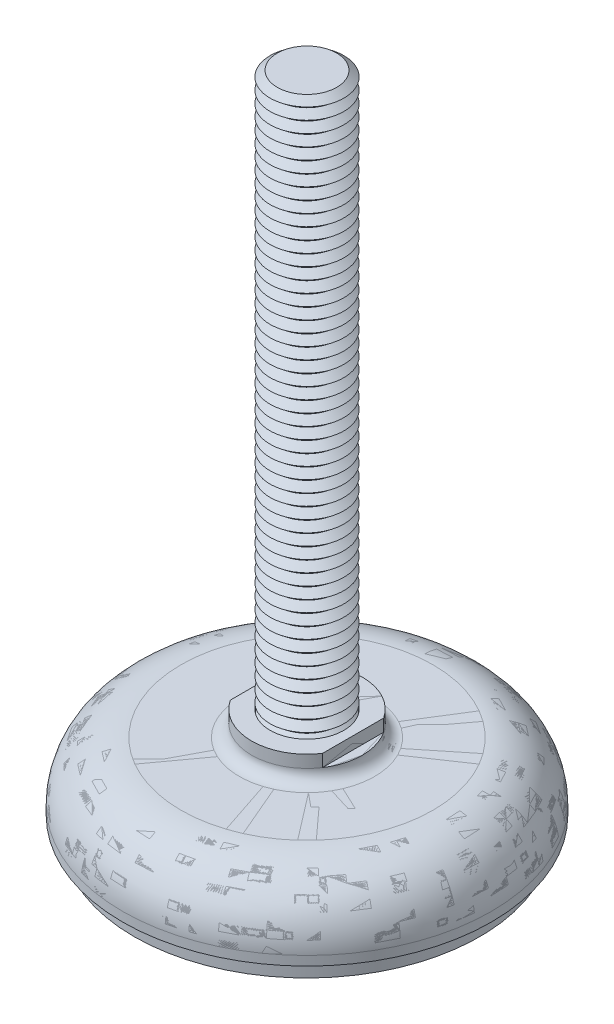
ISO-10303-21;
HEADER;
FILE_DESCRIPTION(('STEP AP214'),'2;1');
FILE_NAME('part.step','',(''),(''),'','','');
FILE_SCHEMA(('AUTOMOTIVE_DESIGN { 1 0 10303 214 1 1 1 1 }'));
ENDSEC;
DATA;
#1=APPLICATION_CONTEXT('core data for automotive mechanical design processes');
#2=APPLICATION_PROTOCOL_DEFINITION('international standard','automotive_design',2000,#1);
#3=PRODUCT_CONTEXT('',#1,'mechanical');
#4=PRODUCT('Part','Part','',(#3));
#5=PRODUCT_RELATED_PRODUCT_CATEGORY('part','',(#4));
#6=PRODUCT_DEFINITION_FORMATION('','',#4);
#7=PRODUCT_DEFINITION_CONTEXT('part definition',#1,'design');
#8=PRODUCT_DEFINITION('design','',#6,#7);
#9=PRODUCT_DEFINITION_SHAPE('','',#8);
#10=(LENGTH_UNIT() NAMED_UNIT(*) SI_UNIT(.MILLI.,.METRE.));
#11=(NAMED_UNIT(*) PLANE_ANGLE_UNIT() SI_UNIT($,.RADIAN.));
#12=(NAMED_UNIT(*) SI_UNIT($,.STERADIAN.) SOLID_ANGLE_UNIT());
#13=UNCERTAINTY_MEASURE_WITH_UNIT(LENGTH_MEASURE(1.E-05),#10,'distance_accuracy_value','');
#14=(GEOMETRIC_REPRESENTATION_CONTEXT(3) GLOBAL_UNCERTAINTY_ASSIGNED_CONTEXT((#13)) GLOBAL_UNIT_ASSIGNED_CONTEXT((#10,
#11,#12)) REPRESENTATION_CONTEXT('',''));
#15=CARTESIAN_POINT('',(0.,0.,0.));
#16=DIRECTION('',(0.,0.,1.));
#17=DIRECTION('',(1.,0.,0.));
#18=AXIS2_PLACEMENT_3D('',#15,#16,#17);
#19=CARTESIAN_POINT('',(0.,67.75,0.));
#20=DIRECTION('',(0.,-1.,0.));
#21=DIRECTION('',(0.998136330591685,0.,-0.0610234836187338));
#22=AXIS2_PLACEMENT_3D('',#19,#20,#21);
#23=CONICAL_SURFACE('',#22,3.2193752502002,0.895664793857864);
#24=CARTESIAN_POINT('',(0.,67.125,0.));
#25=DIRECTION('',(0.,-1.,0.));
#26=DIRECTION('',(0.998136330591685,0.,-0.0610234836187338));
#27=AXIS2_PLACEMENT_3D('',#24,#25,#26);
#28=CIRCLE('',#27,4.);
#29=CARTESIAN_POINT('',(3.99254532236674,67.125,-0.244093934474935));
#30=VERTEX_POINT('',#29);
#31=EDGE_CURVE('P0_E37',#30,#30,#28,.T.);
#32=ORIENTED_EDGE('',*,*,#31,.F.);
#33=EDGE_LOOP('',(#32));
#34=FACE_BOUND('',#33,.T.);
#35=CARTESIAN_POINT('',(0.,67.75,0.));
#36=DIRECTION('',(0.,-1.,0.));
#37=DIRECTION('',(0.998136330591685,0.,-0.0610234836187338));
#38=AXIS2_PLACEMENT_3D('',#35,#36,#37);
#39=CIRCLE('',#38,3.2193752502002);
#40=CARTESIAN_POINT('',(3.21337539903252,67.75,-0.196457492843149));
#41=VERTEX_POINT('',#40);
#42=EDGE_CURVE('P0_E25',#41,#41,#39,.T.);
#43=ORIENTED_EDGE('',*,*,#42,.T.);
#44=EDGE_LOOP('',(#43));
#45=FACE_BOUND('',#44,.T.);
#46=ADVANCED_FACE('P0_F14',(#34,#45),#23,.T.);
#47=CARTESIAN_POINT('',(0.,68.375,0.));
#48=DIRECTION('',(0.,1.,0.));
#49=DIRECTION('',(-0.998136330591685,0.,0.0610234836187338));
#50=AXIS2_PLACEMENT_3D('',#47,#48,#49);
#51=CONICAL_SURFACE('',#50,4.,0.895664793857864);
#52=ORIENTED_EDGE('',*,*,#42,.F.);
#53=EDGE_LOOP('',(#52));
#54=FACE_BOUND('',#53,.T.);
#55=CARTESIAN_POINT('',(0.,68.375,0.));
#56=DIRECTION('',(0.,-1.,0.));
#57=DIRECTION('',(0.998136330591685,0.,-0.0610234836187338));
#58=AXIS2_PLACEMENT_3D('',#55,#56,#57);
#59=CIRCLE('',#58,4.);
#60=CARTESIAN_POINT('',(3.99254532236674,68.375,-0.244093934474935));
#61=VERTEX_POINT('',#60);
#62=EDGE_CURVE('P0_E29',#61,#61,#59,.T.);
#63=ORIENTED_EDGE('',*,*,#62,.T.);
#64=EDGE_LOOP('',(#63));
#65=FACE_BOUND('',#64,.T.);
#66=ADVANCED_FACE('P0_F961',(#54,#65),#51,.T.);
#67=CARTESIAN_POINT('',(0.,69.,0.));
#68=DIRECTION('',(0.,1.,0.));
#69=DIRECTION('',(-0.998136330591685,0.,0.0610234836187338));
#70=AXIS2_PLACEMENT_3D('',#67,#68,#69);
#71=PLANE('',#70);
#72=CARTESIAN_POINT('',(0.,69.,0.));
#73=DIRECTION('',(0.,-1.,0.));
#74=DIRECTION('',(0.998136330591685,0.,-0.0610234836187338));
#75=AXIS2_PLACEMENT_3D('',#72,#73,#74);
#76=CIRCLE('',#75,3.2193752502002);
#77=CARTESIAN_POINT('',(3.21337539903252,69.,-0.196457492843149));
#78=VERTEX_POINT('',#77);
#79=EDGE_CURVE('P0_E21',#78,#78,#76,.T.);
#80=ORIENTED_EDGE('',*,*,#79,.F.);
#81=EDGE_LOOP('',(#80));
#82=FACE_BOUND('',#81,.T.);
#83=ADVANCED_FACE('P0_F967',(#82),#71,.T.);
#84=CARTESIAN_POINT('',(0.,69.,0.));
#85=DIRECTION('',(0.,-1.,0.));
#86=DIRECTION('',(0.998136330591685,0.,-0.0610234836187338));
#87=AXIS2_PLACEMENT_3D('',#84,#85,#86);
#88=CONICAL_SURFACE('',#87,3.2193752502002,0.895664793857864);
#89=ORIENTED_EDGE('',*,*,#62,.F.);
#90=EDGE_LOOP('',(#89));
#91=FACE_BOUND('',#90,.T.);
#92=ORIENTED_EDGE('',*,*,#79,.T.);
#93=EDGE_LOOP('',(#92));
#94=FACE_BOUND('',#93,.T.);
#95=ADVANCED_FACE('P0_F950',(#91,#94),#88,.T.);
#96=CARTESIAN_POINT('',(0.,66.5,0.));
#97=DIRECTION('',(0.,-1.,0.));
#98=DIRECTION('',(0.998136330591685,0.,-0.0610234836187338));
#99=AXIS2_PLACEMENT_3D('',#96,#97,#98);
#100=CONICAL_SURFACE('',#99,3.2193752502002,0.895664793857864);
#101=CARTESIAN_POINT('',(0.,65.875,0.));
#102=DIRECTION('',(0.,-1.,0.));
#103=DIRECTION('',(0.998136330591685,0.,-0.0610234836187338));
#104=AXIS2_PLACEMENT_3D('',#101,#102,#103);
#105=CIRCLE('',#104,4.);
#106=CARTESIAN_POINT('',(3.99254532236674,65.875,-0.244093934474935));
#107=VERTEX_POINT('',#106);
#108=EDGE_CURVE('P0_E43',#107,#107,#105,.T.);
#109=ORIENTED_EDGE('',*,*,#108,.F.);
#110=EDGE_LOOP('',(#109));
#111=FACE_BOUND('',#110,.T.);
#112=CARTESIAN_POINT('',(0.,66.5,0.));
#113=DIRECTION('',(0.,-1.,0.));
#114=DIRECTION('',(0.998136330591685,0.,-0.0610234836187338));
#115=AXIS2_PLACEMENT_3D('',#112,#113,#114);
#116=CIRCLE('',#115,3.2193752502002);
#117=CARTESIAN_POINT('',(3.21337539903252,66.5,-0.196457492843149));
#118=VERTEX_POINT('',#117);
#119=EDGE_CURVE('P0_E34',#118,#118,#116,.T.);
#120=ORIENTED_EDGE('',*,*,#119,.T.);
#121=EDGE_LOOP('',(#120));
#122=FACE_BOUND('',#121,.T.);
#123=ADVANCED_FACE('P0_F947',(#111,#122),#100,.T.);
#124=CARTESIAN_POINT('',(0.,67.125,0.));
#125=DIRECTION('',(0.,1.,0.));
#126=DIRECTION('',(-0.998136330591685,0.,0.0610234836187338));
#127=AXIS2_PLACEMENT_3D('',#124,#125,#126);
#128=CONICAL_SURFACE('',#127,4.,0.895664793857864);
#129=ORIENTED_EDGE('',*,*,#119,.F.);
#130=EDGE_LOOP('',(#129));
#131=FACE_BOUND('',#130,.T.);
#132=ORIENTED_EDGE('',*,*,#31,.T.);
#133=EDGE_LOOP('',(#132));
#134=FACE_BOUND('',#133,.T.);
#135=ADVANCED_FACE('P0_F938',(#131,#134),#128,.T.);
#136=CARTESIAN_POINT('',(0.,65.25,0.));
#137=DIRECTION('',(0.,-1.,0.));
#138=DIRECTION('',(0.998136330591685,0.,-0.0610234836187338));
#139=AXIS2_PLACEMENT_3D('',#136,#137,#138);
#140=CONICAL_SURFACE('',#139,3.2193752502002,0.895664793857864);
#141=CARTESIAN_POINT('',(0.,64.625,0.));
#142=DIRECTION('',(0.,-1.,0.));
#143=DIRECTION('',(0.998136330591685,0.,-0.0610234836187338));
#144=AXIS2_PLACEMENT_3D('',#141,#142,#143);
#145=CIRCLE('',#144,4.);
#146=CARTESIAN_POINT('',(3.99254532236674,64.625,-0.244093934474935));
#147=VERTEX_POINT('',#146);
#148=EDGE_CURVE('P0_E49',#147,#147,#145,.T.);
#149=ORIENTED_EDGE('',*,*,#148,.F.);
#150=EDGE_LOOP('',(#149));
#151=FACE_BOUND('',#150,.T.);
#152=CARTESIAN_POINT('',(0.,65.25,0.));
#153=DIRECTION('',(0.,-1.,0.));
#154=DIRECTION('',(0.998136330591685,0.,-0.0610234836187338));
#155=AXIS2_PLACEMENT_3D('',#152,#153,#154);
#156=CIRCLE('',#155,3.2193752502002);
#157=CARTESIAN_POINT('',(3.21337539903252,65.25,-0.196457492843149));
#158=VERTEX_POINT('',#157);
#159=EDGE_CURVE('P0_E40',#158,#158,#156,.T.);
#160=ORIENTED_EDGE('',*,*,#159,.T.);
#161=EDGE_LOOP('',(#160));
#162=FACE_BOUND('',#161,.T.);
#163=ADVANCED_FACE('P0_F935',(#151,#162),#140,.T.);
#164=CARTESIAN_POINT('',(0.,65.875,0.));
#165=DIRECTION('',(0.,1.,0.));
#166=DIRECTION('',(-0.998136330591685,0.,0.0610234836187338));
#167=AXIS2_PLACEMENT_3D('',#164,#165,#166);
#168=CONICAL_SURFACE('',#167,4.,0.895664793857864);
#169=ORIENTED_EDGE('',*,*,#159,.F.);
#170=EDGE_LOOP('',(#169));
#171=FACE_BOUND('',#170,.T.);
#172=ORIENTED_EDGE('',*,*,#108,.T.);
#173=EDGE_LOOP('',(#172));
#174=FACE_BOUND('',#173,.T.);
#175=ADVANCED_FACE('P0_F926',(#171,#174),#168,.T.);
#176=CARTESIAN_POINT('',(0.,64.,0.));
#177=DIRECTION('',(0.,-1.,0.));
#178=DIRECTION('',(0.998136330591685,0.,-0.0610234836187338));
#179=AXIS2_PLACEMENT_3D('',#176,#177,#178);
#180=CONICAL_SURFACE('',#179,3.2193752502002,0.895664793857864);
#181=CARTESIAN_POINT('',(0.,63.375,0.));
#182=DIRECTION('',(0.,-1.,0.));
#183=DIRECTION('',(0.998136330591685,0.,-0.0610234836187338));
#184=AXIS2_PLACEMENT_3D('',#181,#182,#183);
#185=CIRCLE('',#184,4.);
#186=CARTESIAN_POINT('',(3.99254532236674,63.375,-0.244093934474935));
#187=VERTEX_POINT('',#186);
#188=EDGE_CURVE('P0_E55',#187,#187,#185,.T.);
#189=ORIENTED_EDGE('',*,*,#188,.F.);
#190=EDGE_LOOP('',(#189));
#191=FACE_BOUND('',#190,.T.);
#192=CARTESIAN_POINT('',(0.,64.,0.));
#193=DIRECTION('',(0.,-1.,0.));
#194=DIRECTION('',(0.998136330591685,0.,-0.0610234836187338));
#195=AXIS2_PLACEMENT_3D('',#192,#193,#194);
#196=CIRCLE('',#195,3.2193752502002);
#197=CARTESIAN_POINT('',(3.21337539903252,64.,-0.196457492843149));
#198=VERTEX_POINT('',#197);
#199=EDGE_CURVE('P0_E46',#198,#198,#196,.T.);
#200=ORIENTED_EDGE('',*,*,#199,.T.);
#201=EDGE_LOOP('',(#200));
#202=FACE_BOUND('',#201,.T.);
#203=ADVANCED_FACE('P0_F923',(#191,#202),#180,.T.);
#204=CARTESIAN_POINT('',(0.,64.625,0.));
#205=DIRECTION('',(0.,1.,0.));
#206=DIRECTION('',(-0.998136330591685,0.,0.0610234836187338));
#207=AXIS2_PLACEMENT_3D('',#204,#205,#206);
#208=CONICAL_SURFACE('',#207,4.,0.895664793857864);
#209=ORIENTED_EDGE('',*,*,#199,.F.);
#210=EDGE_LOOP('',(#209));
#211=FACE_BOUND('',#210,.T.);
#212=ORIENTED_EDGE('',*,*,#148,.T.);
#213=EDGE_LOOP('',(#212));
#214=FACE_BOUND('',#213,.T.);
#215=ADVANCED_FACE('P0_F914',(#211,#214),#208,.T.);
#216=CARTESIAN_POINT('',(0.,62.75,0.));
#217=DIRECTION('',(0.,-1.,0.));
#218=DIRECTION('',(0.998136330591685,0.,-0.0610234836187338));
#219=AXIS2_PLACEMENT_3D('',#216,#217,#218);
#220=CONICAL_SURFACE('',#219,3.2193752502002,0.895664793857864);
#221=CARTESIAN_POINT('',(0.,62.125,0.));
#222=DIRECTION('',(0.,-1.,0.));
#223=DIRECTION('',(0.998136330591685,0.,-0.0610234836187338));
#224=AXIS2_PLACEMENT_3D('',#221,#222,#223);
#225=CIRCLE('',#224,4.);
#226=CARTESIAN_POINT('',(3.99254532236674,62.125,-0.244093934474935));
#227=VERTEX_POINT('',#226);
#228=EDGE_CURVE('P0_E61',#227,#227,#225,.T.);
#229=ORIENTED_EDGE('',*,*,#228,.F.);
#230=EDGE_LOOP('',(#229));
#231=FACE_BOUND('',#230,.T.);
#232=CARTESIAN_POINT('',(0.,62.75,0.));
#233=DIRECTION('',(0.,-1.,0.));
#234=DIRECTION('',(0.998136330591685,0.,-0.0610234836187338));
#235=AXIS2_PLACEMENT_3D('',#232,#233,#234);
#236=CIRCLE('',#235,3.2193752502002);
#237=CARTESIAN_POINT('',(3.21337539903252,62.75,-0.196457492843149));
#238=VERTEX_POINT('',#237);
#239=EDGE_CURVE('P0_E52',#238,#238,#236,.T.);
#240=ORIENTED_EDGE('',*,*,#239,.T.);
#241=EDGE_LOOP('',(#240));
#242=FACE_BOUND('',#241,.T.);
#243=ADVANCED_FACE('P0_F911',(#231,#242),#220,.T.);
#244=CARTESIAN_POINT('',(0.,63.375,0.));
#245=DIRECTION('',(0.,1.,0.));
#246=DIRECTION('',(-0.998136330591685,0.,0.0610234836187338));
#247=AXIS2_PLACEMENT_3D('',#244,#245,#246);
#248=CONICAL_SURFACE('',#247,4.,0.895664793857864);
#249=ORIENTED_EDGE('',*,*,#239,.F.);
#250=EDGE_LOOP('',(#249));
#251=FACE_BOUND('',#250,.T.);
#252=ORIENTED_EDGE('',*,*,#188,.T.);
#253=EDGE_LOOP('',(#252));
#254=FACE_BOUND('',#253,.T.);
#255=ADVANCED_FACE('P0_F902',(#251,#254),#248,.T.);
#256=CARTESIAN_POINT('',(0.,61.5,0.));
#257=DIRECTION('',(0.,-1.,0.));
#258=DIRECTION('',(0.998136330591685,0.,-0.0610234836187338));
#259=AXIS2_PLACEMENT_3D('',#256,#257,#258);
#260=CONICAL_SURFACE('',#259,3.2193752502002,0.895664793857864);
#261=CARTESIAN_POINT('',(0.,60.875,0.));
#262=DIRECTION('',(0.,-1.,0.));
#263=DIRECTION('',(0.998136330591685,0.,-0.0610234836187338));
#264=AXIS2_PLACEMENT_3D('',#261,#262,#263);
#265=CIRCLE('',#264,4.);
#266=CARTESIAN_POINT('',(3.99254532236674,60.875,-0.244093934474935));
#267=VERTEX_POINT('',#266);
#268=EDGE_CURVE('P0_E67',#267,#267,#265,.T.);
#269=ORIENTED_EDGE('',*,*,#268,.F.);
#270=EDGE_LOOP('',(#269));
#271=FACE_BOUND('',#270,.T.);
#272=CARTESIAN_POINT('',(0.,61.5,0.));
#273=DIRECTION('',(0.,-1.,0.));
#274=DIRECTION('',(0.998136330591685,0.,-0.0610234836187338));
#275=AXIS2_PLACEMENT_3D('',#272,#273,#274);
#276=CIRCLE('',#275,3.2193752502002);
#277=CARTESIAN_POINT('',(3.21337539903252,61.5,-0.196457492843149));
#278=VERTEX_POINT('',#277);
#279=EDGE_CURVE('P0_E58',#278,#278,#276,.T.);
#280=ORIENTED_EDGE('',*,*,#279,.T.);
#281=EDGE_LOOP('',(#280));
#282=FACE_BOUND('',#281,.T.);
#283=ADVANCED_FACE('P0_F899',(#271,#282),#260,.T.);
#284=CARTESIAN_POINT('',(0.,62.125,0.));
#285=DIRECTION('',(0.,1.,0.));
#286=DIRECTION('',(-0.998136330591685,0.,0.0610234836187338));
#287=AXIS2_PLACEMENT_3D('',#284,#285,#286);
#288=CONICAL_SURFACE('',#287,4.,0.895664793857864);
#289=ORIENTED_EDGE('',*,*,#279,.F.);
#290=EDGE_LOOP('',(#289));
#291=FACE_BOUND('',#290,.T.);
#292=ORIENTED_EDGE('',*,*,#228,.T.);
#293=EDGE_LOOP('',(#292));
#294=FACE_BOUND('',#293,.T.);
#295=ADVANCED_FACE('P0_F890',(#291,#294),#288,.T.);
#296=CARTESIAN_POINT('',(0.,60.25,0.));
#297=DIRECTION('',(0.,-1.,0.));
#298=DIRECTION('',(0.998136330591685,0.,-0.0610234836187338));
#299=AXIS2_PLACEMENT_3D('',#296,#297,#298);
#300=CONICAL_SURFACE('',#299,3.2193752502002,0.895664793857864);
#301=CARTESIAN_POINT('',(0.,59.625,0.));
#302=DIRECTION('',(0.,-1.,0.));
#303=DIRECTION('',(0.998136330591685,0.,-0.0610234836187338));
#304=AXIS2_PLACEMENT_3D('',#301,#302,#303);
#305=CIRCLE('',#304,4.);
#306=CARTESIAN_POINT('',(3.99254532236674,59.625,-0.244093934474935));
#307=VERTEX_POINT('',#306);
#308=EDGE_CURVE('P0_E73',#307,#307,#305,.T.);
#309=ORIENTED_EDGE('',*,*,#308,.F.);
#310=EDGE_LOOP('',(#309));
#311=FACE_BOUND('',#310,.T.);
#312=CARTESIAN_POINT('',(0.,60.25,0.));
#313=DIRECTION('',(0.,-1.,0.));
#314=DIRECTION('',(0.998136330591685,0.,-0.0610234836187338));
#315=AXIS2_PLACEMENT_3D('',#312,#313,#314);
#316=CIRCLE('',#315,3.2193752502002);
#317=CARTESIAN_POINT('',(3.21337539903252,60.25,-0.196457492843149));
#318=VERTEX_POINT('',#317);
#319=EDGE_CURVE('P0_E64',#318,#318,#316,.T.);
#320=ORIENTED_EDGE('',*,*,#319,.T.);
#321=EDGE_LOOP('',(#320));
#322=FACE_BOUND('',#321,.T.);
#323=ADVANCED_FACE('P0_F887',(#311,#322),#300,.T.);
#324=CARTESIAN_POINT('',(0.,60.875,0.));
#325=DIRECTION('',(0.,1.,0.));
#326=DIRECTION('',(-0.998136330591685,0.,0.0610234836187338));
#327=AXIS2_PLACEMENT_3D('',#324,#325,#326);
#328=CONICAL_SURFACE('',#327,4.,0.895664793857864);
#329=ORIENTED_EDGE('',*,*,#319,.F.);
#330=EDGE_LOOP('',(#329));
#331=FACE_BOUND('',#330,.T.);
#332=ORIENTED_EDGE('',*,*,#268,.T.);
#333=EDGE_LOOP('',(#332));
#334=FACE_BOUND('',#333,.T.);
#335=ADVANCED_FACE('P0_F878',(#331,#334),#328,.T.);
#336=CARTESIAN_POINT('',(0.,59.,0.));
#337=DIRECTION('',(0.,-1.,0.));
#338=DIRECTION('',(0.998136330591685,0.,-0.0610234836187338));
#339=AXIS2_PLACEMENT_3D('',#336,#337,#338);
#340=CONICAL_SURFACE('',#339,3.2193752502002,0.895664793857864);
#341=CARTESIAN_POINT('',(0.,58.375,0.));
#342=DIRECTION('',(0.,-1.,0.));
#343=DIRECTION('',(0.998136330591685,0.,-0.0610234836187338));
#344=AXIS2_PLACEMENT_3D('',#341,#342,#343);
#345=CIRCLE('',#344,4.);
#346=CARTESIAN_POINT('',(3.99254532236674,58.375,-0.244093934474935));
#347=VERTEX_POINT('',#346);
#348=EDGE_CURVE('P0_E79',#347,#347,#345,.T.);
#349=ORIENTED_EDGE('',*,*,#348,.F.);
#350=EDGE_LOOP('',(#349));
#351=FACE_BOUND('',#350,.T.);
#352=CARTESIAN_POINT('',(0.,59.,0.));
#353=DIRECTION('',(0.,-1.,0.));
#354=DIRECTION('',(0.998136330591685,0.,-0.0610234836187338));
#355=AXIS2_PLACEMENT_3D('',#352,#353,#354);
#356=CIRCLE('',#355,3.2193752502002);
#357=CARTESIAN_POINT('',(3.21337539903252,59.,-0.196457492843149));
#358=VERTEX_POINT('',#357);
#359=EDGE_CURVE('P0_E70',#358,#358,#356,.T.);
#360=ORIENTED_EDGE('',*,*,#359,.T.);
#361=EDGE_LOOP('',(#360));
#362=FACE_BOUND('',#361,.T.);
#363=ADVANCED_FACE('P0_F875',(#351,#362),#340,.T.);
#364=CARTESIAN_POINT('',(0.,59.625,0.));
#365=DIRECTION('',(0.,1.,0.));
#366=DIRECTION('',(-0.998136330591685,0.,0.0610234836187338));
#367=AXIS2_PLACEMENT_3D('',#364,#365,#366);
#368=CONICAL_SURFACE('',#367,4.,0.895664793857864);
#369=ORIENTED_EDGE('',*,*,#359,.F.);
#370=EDGE_LOOP('',(#369));
#371=FACE_BOUND('',#370,.T.);
#372=ORIENTED_EDGE('',*,*,#308,.T.);
#373=EDGE_LOOP('',(#372));
#374=FACE_BOUND('',#373,.T.);
#375=ADVANCED_FACE('P0_F866',(#371,#374),#368,.T.);
#376=CARTESIAN_POINT('',(0.,57.75,0.));
#377=DIRECTION('',(0.,-1.,0.));
#378=DIRECTION('',(0.998136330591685,0.,-0.0610234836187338));
#379=AXIS2_PLACEMENT_3D('',#376,#377,#378);
#380=CONICAL_SURFACE('',#379,3.2193752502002,0.895664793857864);
#381=CARTESIAN_POINT('',(0.,57.125,0.));
#382=DIRECTION('',(0.,-1.,0.));
#383=DIRECTION('',(0.998136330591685,0.,-0.0610234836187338));
#384=AXIS2_PLACEMENT_3D('',#381,#382,#383);
#385=CIRCLE('',#384,4.);
#386=CARTESIAN_POINT('',(3.99254532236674,57.125,-0.244093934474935));
#387=VERTEX_POINT('',#386);
#388=EDGE_CURVE('P0_E85',#387,#387,#385,.T.);
#389=ORIENTED_EDGE('',*,*,#388,.F.);
#390=EDGE_LOOP('',(#389));
#391=FACE_BOUND('',#390,.T.);
#392=CARTESIAN_POINT('',(0.,57.75,0.));
#393=DIRECTION('',(0.,-1.,0.));
#394=DIRECTION('',(0.998136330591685,0.,-0.0610234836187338));
#395=AXIS2_PLACEMENT_3D('',#392,#393,#394);
#396=CIRCLE('',#395,3.2193752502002);
#397=CARTESIAN_POINT('',(3.21337539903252,57.75,-0.196457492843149));
#398=VERTEX_POINT('',#397);
#399=EDGE_CURVE('P0_E76',#398,#398,#396,.T.);
#400=ORIENTED_EDGE('',*,*,#399,.T.);
#401=EDGE_LOOP('',(#400));
#402=FACE_BOUND('',#401,.T.);
#403=ADVANCED_FACE('P0_F863',(#391,#402),#380,.T.);
#404=CARTESIAN_POINT('',(0.,58.375,0.));
#405=DIRECTION('',(0.,1.,0.));
#406=DIRECTION('',(-0.998136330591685,0.,0.0610234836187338));
#407=AXIS2_PLACEMENT_3D('',#404,#405,#406);
#408=CONICAL_SURFACE('',#407,4.,0.895664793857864);
#409=ORIENTED_EDGE('',*,*,#399,.F.);
#410=EDGE_LOOP('',(#409));
#411=FACE_BOUND('',#410,.T.);
#412=ORIENTED_EDGE('',*,*,#348,.T.);
#413=EDGE_LOOP('',(#412));
#414=FACE_BOUND('',#413,.T.);
#415=ADVANCED_FACE('P0_F854',(#411,#414),#408,.T.);
#416=CARTESIAN_POINT('',(0.,56.5,0.));
#417=DIRECTION('',(0.,-1.,0.));
#418=DIRECTION('',(0.998136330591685,0.,-0.0610234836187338));
#419=AXIS2_PLACEMENT_3D('',#416,#417,#418);
#420=CONICAL_SURFACE('',#419,3.2193752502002,0.895664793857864);
#421=CARTESIAN_POINT('',(0.,55.875,0.));
#422=DIRECTION('',(0.,-1.,0.));
#423=DIRECTION('',(0.998136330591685,0.,-0.0610234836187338));
#424=AXIS2_PLACEMENT_3D('',#421,#422,#423);
#425=CIRCLE('',#424,4.);
#426=CARTESIAN_POINT('',(3.99254532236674,55.875,-0.244093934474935));
#427=VERTEX_POINT('',#426);
#428=EDGE_CURVE('P0_E91',#427,#427,#425,.T.);
#429=ORIENTED_EDGE('',*,*,#428,.F.);
#430=EDGE_LOOP('',(#429));
#431=FACE_BOUND('',#430,.T.);
#432=CARTESIAN_POINT('',(0.,56.5,0.));
#433=DIRECTION('',(0.,-1.,0.));
#434=DIRECTION('',(0.998136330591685,0.,-0.0610234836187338));
#435=AXIS2_PLACEMENT_3D('',#432,#433,#434);
#436=CIRCLE('',#435,3.2193752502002);
#437=CARTESIAN_POINT('',(3.21337539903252,56.5,-0.196457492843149));
#438=VERTEX_POINT('',#437);
#439=EDGE_CURVE('P0_E82',#438,#438,#436,.T.);
#440=ORIENTED_EDGE('',*,*,#439,.T.);
#441=EDGE_LOOP('',(#440));
#442=FACE_BOUND('',#441,.T.);
#443=ADVANCED_FACE('P0_F851',(#431,#442),#420,.T.);
#444=CARTESIAN_POINT('',(0.,57.125,0.));
#445=DIRECTION('',(0.,1.,0.));
#446=DIRECTION('',(-0.998136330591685,0.,0.0610234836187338));
#447=AXIS2_PLACEMENT_3D('',#444,#445,#446);
#448=CONICAL_SURFACE('',#447,4.,0.895664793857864);
#449=ORIENTED_EDGE('',*,*,#439,.F.);
#450=EDGE_LOOP('',(#449));
#451=FACE_BOUND('',#450,.T.);
#452=ORIENTED_EDGE('',*,*,#388,.T.);
#453=EDGE_LOOP('',(#452));
#454=FACE_BOUND('',#453,.T.);
#455=ADVANCED_FACE('P0_F842',(#451,#454),#448,.T.);
#456=CARTESIAN_POINT('',(0.,55.25,0.));
#457=DIRECTION('',(0.,-1.,0.));
#458=DIRECTION('',(0.998136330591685,0.,-0.0610234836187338));
#459=AXIS2_PLACEMENT_3D('',#456,#457,#458);
#460=CONICAL_SURFACE('',#459,3.2193752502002,0.895664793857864);
#461=CARTESIAN_POINT('',(0.,54.625,0.));
#462=DIRECTION('',(0.,-1.,0.));
#463=DIRECTION('',(0.998136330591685,0.,-0.0610234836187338));
#464=AXIS2_PLACEMENT_3D('',#461,#462,#463);
#465=CIRCLE('',#464,4.);
#466=CARTESIAN_POINT('',(3.99254532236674,54.625,-0.244093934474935));
#467=VERTEX_POINT('',#466);
#468=EDGE_CURVE('P0_E97',#467,#467,#465,.T.);
#469=ORIENTED_EDGE('',*,*,#468,.F.);
#470=EDGE_LOOP('',(#469));
#471=FACE_BOUND('',#470,.T.);
#472=CARTESIAN_POINT('',(0.,55.25,0.));
#473=DIRECTION('',(0.,-1.,0.));
#474=DIRECTION('',(0.998136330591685,0.,-0.0610234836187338));
#475=AXIS2_PLACEMENT_3D('',#472,#473,#474);
#476=CIRCLE('',#475,3.2193752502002);
#477=CARTESIAN_POINT('',(3.21337539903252,55.25,-0.196457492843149));
#478=VERTEX_POINT('',#477);
#479=EDGE_CURVE('P0_E88',#478,#478,#476,.T.);
#480=ORIENTED_EDGE('',*,*,#479,.T.);
#481=EDGE_LOOP('',(#480));
#482=FACE_BOUND('',#481,.T.);
#483=ADVANCED_FACE('P0_F839',(#471,#482),#460,.T.);
#484=CARTESIAN_POINT('',(0.,55.875,0.));
#485=DIRECTION('',(0.,1.,0.));
#486=DIRECTION('',(-0.998136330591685,0.,0.0610234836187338));
#487=AXIS2_PLACEMENT_3D('',#484,#485,#486);
#488=CONICAL_SURFACE('',#487,4.,0.895664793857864);
#489=ORIENTED_EDGE('',*,*,#479,.F.);
#490=EDGE_LOOP('',(#489));
#491=FACE_BOUND('',#490,.T.);
#492=ORIENTED_EDGE('',*,*,#428,.T.);
#493=EDGE_LOOP('',(#492));
#494=FACE_BOUND('',#493,.T.);
#495=ADVANCED_FACE('P0_F830',(#491,#494),#488,.T.);
#496=CARTESIAN_POINT('',(0.,54.,0.));
#497=DIRECTION('',(0.,-1.,0.));
#498=DIRECTION('',(0.998136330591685,0.,-0.0610234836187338));
#499=AXIS2_PLACEMENT_3D('',#496,#497,#498);
#500=CONICAL_SURFACE('',#499,3.2193752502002,0.895664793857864);
#501=CARTESIAN_POINT('',(0.,53.375,0.));
#502=DIRECTION('',(0.,-1.,0.));
#503=DIRECTION('',(0.998136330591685,0.,-0.0610234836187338));
#504=AXIS2_PLACEMENT_3D('',#501,#502,#503);
#505=CIRCLE('',#504,4.);
#506=CARTESIAN_POINT('',(3.99254532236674,53.375,-0.244093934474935));
#507=VERTEX_POINT('',#506);
#508=EDGE_CURVE('P0_E103',#507,#507,#505,.T.);
#509=ORIENTED_EDGE('',*,*,#508,.F.);
#510=EDGE_LOOP('',(#509));
#511=FACE_BOUND('',#510,.T.);
#512=CARTESIAN_POINT('',(0.,54.,0.));
#513=DIRECTION('',(0.,-1.,0.));
#514=DIRECTION('',(0.998136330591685,0.,-0.0610234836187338));
#515=AXIS2_PLACEMENT_3D('',#512,#513,#514);
#516=CIRCLE('',#515,3.2193752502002);
#517=CARTESIAN_POINT('',(3.21337539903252,54.,-0.196457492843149));
#518=VERTEX_POINT('',#517);
#519=EDGE_CURVE('P0_E94',#518,#518,#516,.T.);
#520=ORIENTED_EDGE('',*,*,#519,.T.);
#521=EDGE_LOOP('',(#520));
#522=FACE_BOUND('',#521,.T.);
#523=ADVANCED_FACE('P0_F827',(#511,#522),#500,.T.);
#524=CARTESIAN_POINT('',(0.,54.625,0.));
#525=DIRECTION('',(0.,1.,0.));
#526=DIRECTION('',(-0.998136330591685,0.,0.0610234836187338));
#527=AXIS2_PLACEMENT_3D('',#524,#525,#526);
#528=CONICAL_SURFACE('',#527,4.,0.895664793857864);
#529=ORIENTED_EDGE('',*,*,#519,.F.);
#530=EDGE_LOOP('',(#529));
#531=FACE_BOUND('',#530,.T.);
#532=ORIENTED_EDGE('',*,*,#468,.T.);
#533=EDGE_LOOP('',(#532));
#534=FACE_BOUND('',#533,.T.);
#535=ADVANCED_FACE('P0_F818',(#531,#534),#528,.T.);
#536=CARTESIAN_POINT('',(0.,52.75,0.));
#537=DIRECTION('',(0.,-1.,0.));
#538=DIRECTION('',(0.998136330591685,0.,-0.0610234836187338));
#539=AXIS2_PLACEMENT_3D('',#536,#537,#538);
#540=CONICAL_SURFACE('',#539,3.2193752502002,0.895664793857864);
#541=CARTESIAN_POINT('',(0.,52.125,0.));
#542=DIRECTION('',(0.,-1.,0.));
#543=DIRECTION('',(0.998136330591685,0.,-0.0610234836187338));
#544=AXIS2_PLACEMENT_3D('',#541,#542,#543);
#545=CIRCLE('',#544,4.);
#546=CARTESIAN_POINT('',(3.99254532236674,52.125,-0.244093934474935));
#547=VERTEX_POINT('',#546);
#548=EDGE_CURVE('P0_E109',#547,#547,#545,.T.);
#549=ORIENTED_EDGE('',*,*,#548,.F.);
#550=EDGE_LOOP('',(#549));
#551=FACE_BOUND('',#550,.T.);
#552=CARTESIAN_POINT('',(0.,52.75,0.));
#553=DIRECTION('',(0.,-1.,0.));
#554=DIRECTION('',(0.998136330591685,0.,-0.0610234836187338));
#555=AXIS2_PLACEMENT_3D('',#552,#553,#554);
#556=CIRCLE('',#555,3.2193752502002);
#557=CARTESIAN_POINT('',(3.21337539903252,52.75,-0.196457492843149));
#558=VERTEX_POINT('',#557);
#559=EDGE_CURVE('P0_E100',#558,#558,#556,.T.);
#560=ORIENTED_EDGE('',*,*,#559,.T.);
#561=EDGE_LOOP('',(#560));
#562=FACE_BOUND('',#561,.T.);
#563=ADVANCED_FACE('P0_F815',(#551,#562),#540,.T.);
#564=CARTESIAN_POINT('',(0.,53.375,0.));
#565=DIRECTION('',(0.,1.,0.));
#566=DIRECTION('',(-0.998136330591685,0.,0.0610234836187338));
#567=AXIS2_PLACEMENT_3D('',#564,#565,#566);
#568=CONICAL_SURFACE('',#567,4.,0.895664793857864);
#569=ORIENTED_EDGE('',*,*,#559,.F.);
#570=EDGE_LOOP('',(#569));
#571=FACE_BOUND('',#570,.T.);
#572=ORIENTED_EDGE('',*,*,#508,.T.);
#573=EDGE_LOOP('',(#572));
#574=FACE_BOUND('',#573,.T.);
#575=ADVANCED_FACE('P0_F806',(#571,#574),#568,.T.);
#576=CARTESIAN_POINT('',(0.,51.5,0.));
#577=DIRECTION('',(0.,-1.,0.));
#578=DIRECTION('',(0.998136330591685,0.,-0.0610234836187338));
#579=AXIS2_PLACEMENT_3D('',#576,#577,#578);
#580=CONICAL_SURFACE('',#579,3.2193752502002,0.895664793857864);
#581=CARTESIAN_POINT('',(0.,50.875,0.));
#582=DIRECTION('',(0.,-1.,0.));
#583=DIRECTION('',(0.998136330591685,0.,-0.0610234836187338));
#584=AXIS2_PLACEMENT_3D('',#581,#582,#583);
#585=CIRCLE('',#584,4.);
#586=CARTESIAN_POINT('',(3.99254532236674,50.875,-0.244093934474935));
#587=VERTEX_POINT('',#586);
#588=EDGE_CURVE('P0_E115',#587,#587,#585,.T.);
#589=ORIENTED_EDGE('',*,*,#588,.F.);
#590=EDGE_LOOP('',(#589));
#591=FACE_BOUND('',#590,.T.);
#592=CARTESIAN_POINT('',(0.,51.5,0.));
#593=DIRECTION('',(0.,-1.,0.));
#594=DIRECTION('',(0.998136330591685,0.,-0.0610234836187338));
#595=AXIS2_PLACEMENT_3D('',#592,#593,#594);
#596=CIRCLE('',#595,3.2193752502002);
#597=CARTESIAN_POINT('',(3.21337539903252,51.5,-0.196457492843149));
#598=VERTEX_POINT('',#597);
#599=EDGE_CURVE('P0_E106',#598,#598,#596,.T.);
#600=ORIENTED_EDGE('',*,*,#599,.T.);
#601=EDGE_LOOP('',(#600));
#602=FACE_BOUND('',#601,.T.);
#603=ADVANCED_FACE('P0_F803',(#591,#602),#580,.T.);
#604=CARTESIAN_POINT('',(0.,52.125,0.));
#605=DIRECTION('',(0.,1.,0.));
#606=DIRECTION('',(-0.998136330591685,0.,0.0610234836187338));
#607=AXIS2_PLACEMENT_3D('',#604,#605,#606);
#608=CONICAL_SURFACE('',#607,4.,0.895664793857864);
#609=ORIENTED_EDGE('',*,*,#599,.F.);
#610=EDGE_LOOP('',(#609));
#611=FACE_BOUND('',#610,.T.);
#612=ORIENTED_EDGE('',*,*,#548,.T.);
#613=EDGE_LOOP('',(#612));
#614=FACE_BOUND('',#613,.T.);
#615=ADVANCED_FACE('P0_F794',(#611,#614),#608,.T.);
#616=CARTESIAN_POINT('',(0.,50.25,0.));
#617=DIRECTION('',(0.,-1.,0.));
#618=DIRECTION('',(0.998136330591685,0.,-0.0610234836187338));
#619=AXIS2_PLACEMENT_3D('',#616,#617,#618);
#620=CONICAL_SURFACE('',#619,3.2193752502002,0.895664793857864);
#621=CARTESIAN_POINT('',(0.,49.625,0.));
#622=DIRECTION('',(0.,-1.,0.));
#623=DIRECTION('',(0.998136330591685,0.,-0.0610234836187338));
#624=AXIS2_PLACEMENT_3D('',#621,#622,#623);
#625=CIRCLE('',#624,4.);
#626=CARTESIAN_POINT('',(3.99254532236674,49.625,-0.244093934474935));
#627=VERTEX_POINT('',#626);
#628=EDGE_CURVE('P0_E121',#627,#627,#625,.T.);
#629=ORIENTED_EDGE('',*,*,#628,.F.);
#630=EDGE_LOOP('',(#629));
#631=FACE_BOUND('',#630,.T.);
#632=CARTESIAN_POINT('',(0.,50.25,0.));
#633=DIRECTION('',(0.,-1.,0.));
#634=DIRECTION('',(0.998136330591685,0.,-0.0610234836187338));
#635=AXIS2_PLACEMENT_3D('',#632,#633,#634);
#636=CIRCLE('',#635,3.2193752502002);
#637=CARTESIAN_POINT('',(3.21337539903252,50.25,-0.196457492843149));
#638=VERTEX_POINT('',#637);
#639=EDGE_CURVE('P0_E112',#638,#638,#636,.T.);
#640=ORIENTED_EDGE('',*,*,#639,.T.);
#641=EDGE_LOOP('',(#640));
#642=FACE_BOUND('',#641,.T.);
#643=ADVANCED_FACE('P0_F791',(#631,#642),#620,.T.);
#644=CARTESIAN_POINT('',(0.,50.875,0.));
#645=DIRECTION('',(0.,1.,0.));
#646=DIRECTION('',(-0.998136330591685,0.,0.0610234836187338));
#647=AXIS2_PLACEMENT_3D('',#644,#645,#646);
#648=CONICAL_SURFACE('',#647,4.,0.895664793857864);
#649=ORIENTED_EDGE('',*,*,#639,.F.);
#650=EDGE_LOOP('',(#649));
#651=FACE_BOUND('',#650,.T.);
#652=ORIENTED_EDGE('',*,*,#588,.T.);
#653=EDGE_LOOP('',(#652));
#654=FACE_BOUND('',#653,.T.);
#655=ADVANCED_FACE('P0_F782',(#651,#654),#648,.T.);
#656=CARTESIAN_POINT('',(0.,49.,0.));
#657=DIRECTION('',(0.,-1.,0.));
#658=DIRECTION('',(0.998136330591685,0.,-0.0610234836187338));
#659=AXIS2_PLACEMENT_3D('',#656,#657,#658);
#660=CONICAL_SURFACE('',#659,3.2193752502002,0.895664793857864);
#661=CARTESIAN_POINT('',(0.,48.375,0.));
#662=DIRECTION('',(0.,-1.,0.));
#663=DIRECTION('',(0.998136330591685,0.,-0.0610234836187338));
#664=AXIS2_PLACEMENT_3D('',#661,#662,#663);
#665=CIRCLE('',#664,4.);
#666=CARTESIAN_POINT('',(3.99254532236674,48.375,-0.244093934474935));
#667=VERTEX_POINT('',#666);
#668=EDGE_CURVE('P0_E127',#667,#667,#665,.T.);
#669=ORIENTED_EDGE('',*,*,#668,.F.);
#670=EDGE_LOOP('',(#669));
#671=FACE_BOUND('',#670,.T.);
#672=CARTESIAN_POINT('',(0.,49.,0.));
#673=DIRECTION('',(0.,-1.,0.));
#674=DIRECTION('',(0.998136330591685,0.,-0.0610234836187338));
#675=AXIS2_PLACEMENT_3D('',#672,#673,#674);
#676=CIRCLE('',#675,3.2193752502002);
#677=CARTESIAN_POINT('',(3.21337539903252,49.,-0.196457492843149));
#678=VERTEX_POINT('',#677);
#679=EDGE_CURVE('P0_E118',#678,#678,#676,.T.);
#680=ORIENTED_EDGE('',*,*,#679,.T.);
#681=EDGE_LOOP('',(#680));
#682=FACE_BOUND('',#681,.T.);
#683=ADVANCED_FACE('P0_F779',(#671,#682),#660,.T.);
#684=CARTESIAN_POINT('',(0.,49.625,0.));
#685=DIRECTION('',(0.,1.,0.));
#686=DIRECTION('',(-0.998136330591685,0.,0.0610234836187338));
#687=AXIS2_PLACEMENT_3D('',#684,#685,#686);
#688=CONICAL_SURFACE('',#687,4.,0.895664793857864);
#689=ORIENTED_EDGE('',*,*,#679,.F.);
#690=EDGE_LOOP('',(#689));
#691=FACE_BOUND('',#690,.T.);
#692=ORIENTED_EDGE('',*,*,#628,.T.);
#693=EDGE_LOOP('',(#692));
#694=FACE_BOUND('',#693,.T.);
#695=ADVANCED_FACE('P0_F770',(#691,#694),#688,.T.);
#696=CARTESIAN_POINT('',(0.,47.75,0.));
#697=DIRECTION('',(0.,-1.,0.));
#698=DIRECTION('',(0.998136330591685,0.,-0.0610234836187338));
#699=AXIS2_PLACEMENT_3D('',#696,#697,#698);
#700=CONICAL_SURFACE('',#699,3.2193752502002,0.895664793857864);
#701=CARTESIAN_POINT('',(0.,47.125,0.));
#702=DIRECTION('',(0.,-1.,0.));
#703=DIRECTION('',(0.998136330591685,0.,-0.0610234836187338));
#704=AXIS2_PLACEMENT_3D('',#701,#702,#703);
#705=CIRCLE('',#704,4.);
#706=CARTESIAN_POINT('',(3.99254532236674,47.125,-0.244093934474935));
#707=VERTEX_POINT('',#706);
#708=EDGE_CURVE('P0_E133',#707,#707,#705,.T.);
#709=ORIENTED_EDGE('',*,*,#708,.F.);
#710=EDGE_LOOP('',(#709));
#711=FACE_BOUND('',#710,.T.);
#712=CARTESIAN_POINT('',(0.,47.75,0.));
#713=DIRECTION('',(0.,-1.,0.));
#714=DIRECTION('',(0.998136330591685,0.,-0.0610234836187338));
#715=AXIS2_PLACEMENT_3D('',#712,#713,#714);
#716=CIRCLE('',#715,3.2193752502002);
#717=CARTESIAN_POINT('',(3.21337539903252,47.75,-0.196457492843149));
#718=VERTEX_POINT('',#717);
#719=EDGE_CURVE('P0_E124',#718,#718,#716,.T.);
#720=ORIENTED_EDGE('',*,*,#719,.T.);
#721=EDGE_LOOP('',(#720));
#722=FACE_BOUND('',#721,.T.);
#723=ADVANCED_FACE('P0_F767',(#711,#722),#700,.T.);
#724=CARTESIAN_POINT('',(0.,48.375,0.));
#725=DIRECTION('',(0.,1.,0.));
#726=DIRECTION('',(-0.998136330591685,0.,0.0610234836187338));
#727=AXIS2_PLACEMENT_3D('',#724,#725,#726);
#728=CONICAL_SURFACE('',#727,4.,0.895664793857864);
#729=ORIENTED_EDGE('',*,*,#719,.F.);
#730=EDGE_LOOP('',(#729));
#731=FACE_BOUND('',#730,.T.);
#732=ORIENTED_EDGE('',*,*,#668,.T.);
#733=EDGE_LOOP('',(#732));
#734=FACE_BOUND('',#733,.T.);
#735=ADVANCED_FACE('P0_F758',(#731,#734),#728,.T.);
#736=CARTESIAN_POINT('',(0.,46.5,0.));
#737=DIRECTION('',(0.,-1.,0.));
#738=DIRECTION('',(0.998136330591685,0.,-0.0610234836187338));
#739=AXIS2_PLACEMENT_3D('',#736,#737,#738);
#740=CONICAL_SURFACE('',#739,3.2193752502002,0.895664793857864);
#741=CARTESIAN_POINT('',(0.,45.875,0.));
#742=DIRECTION('',(0.,-1.,0.));
#743=DIRECTION('',(0.998136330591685,0.,-0.0610234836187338));
#744=AXIS2_PLACEMENT_3D('',#741,#742,#743);
#745=CIRCLE('',#744,4.);
#746=CARTESIAN_POINT('',(3.99254532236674,45.875,-0.244093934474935));
#747=VERTEX_POINT('',#746);
#748=EDGE_CURVE('P0_E139',#747,#747,#745,.T.);
#749=ORIENTED_EDGE('',*,*,#748,.F.);
#750=EDGE_LOOP('',(#749));
#751=FACE_BOUND('',#750,.T.);
#752=CARTESIAN_POINT('',(0.,46.5,0.));
#753=DIRECTION('',(0.,-1.,0.));
#754=DIRECTION('',(0.998136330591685,0.,-0.0610234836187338));
#755=AXIS2_PLACEMENT_3D('',#752,#753,#754);
#756=CIRCLE('',#755,3.2193752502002);
#757=CARTESIAN_POINT('',(3.21337539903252,46.5,-0.196457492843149));
#758=VERTEX_POINT('',#757);
#759=EDGE_CURVE('P0_E130',#758,#758,#756,.T.);
#760=ORIENTED_EDGE('',*,*,#759,.T.);
#761=EDGE_LOOP('',(#760));
#762=FACE_BOUND('',#761,.T.);
#763=ADVANCED_FACE('P0_F755',(#751,#762),#740,.T.);
#764=CARTESIAN_POINT('',(0.,47.125,0.));
#765=DIRECTION('',(0.,1.,0.));
#766=DIRECTION('',(-0.998136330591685,0.,0.0610234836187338));
#767=AXIS2_PLACEMENT_3D('',#764,#765,#766);
#768=CONICAL_SURFACE('',#767,4.,0.895664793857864);
#769=ORIENTED_EDGE('',*,*,#759,.F.);
#770=EDGE_LOOP('',(#769));
#771=FACE_BOUND('',#770,.T.);
#772=ORIENTED_EDGE('',*,*,#708,.T.);
#773=EDGE_LOOP('',(#772));
#774=FACE_BOUND('',#773,.T.);
#775=ADVANCED_FACE('P0_F746',(#771,#774),#768,.T.);
#776=CARTESIAN_POINT('',(0.,45.25,0.));
#777=DIRECTION('',(0.,-1.,0.));
#778=DIRECTION('',(0.998136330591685,0.,-0.0610234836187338));
#779=AXIS2_PLACEMENT_3D('',#776,#777,#778);
#780=CONICAL_SURFACE('',#779,3.2193752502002,0.895664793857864);
#781=CARTESIAN_POINT('',(0.,44.625,0.));
#782=DIRECTION('',(0.,-1.,0.));
#783=DIRECTION('',(0.998136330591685,0.,-0.0610234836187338));
#784=AXIS2_PLACEMENT_3D('',#781,#782,#783);
#785=CIRCLE('',#784,4.);
#786=CARTESIAN_POINT('',(3.99254532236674,44.625,-0.244093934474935));
#787=VERTEX_POINT('',#786);
#788=EDGE_CURVE('P0_E145',#787,#787,#785,.T.);
#789=ORIENTED_EDGE('',*,*,#788,.F.);
#790=EDGE_LOOP('',(#789));
#791=FACE_BOUND('',#790,.T.);
#792=CARTESIAN_POINT('',(0.,45.25,0.));
#793=DIRECTION('',(0.,-1.,0.));
#794=DIRECTION('',(0.998136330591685,0.,-0.0610234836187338));
#795=AXIS2_PLACEMENT_3D('',#792,#793,#794);
#796=CIRCLE('',#795,3.2193752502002);
#797=CARTESIAN_POINT('',(3.21337539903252,45.25,-0.196457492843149));
#798=VERTEX_POINT('',#797);
#799=EDGE_CURVE('P0_E136',#798,#798,#796,.T.);
#800=ORIENTED_EDGE('',*,*,#799,.T.);
#801=EDGE_LOOP('',(#800));
#802=FACE_BOUND('',#801,.T.);
#803=ADVANCED_FACE('P0_F743',(#791,#802),#780,.T.);
#804=CARTESIAN_POINT('',(0.,45.875,0.));
#805=DIRECTION('',(0.,1.,0.));
#806=DIRECTION('',(-0.998136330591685,0.,0.0610234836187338));
#807=AXIS2_PLACEMENT_3D('',#804,#805,#806);
#808=CONICAL_SURFACE('',#807,4.,0.895664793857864);
#809=ORIENTED_EDGE('',*,*,#799,.F.);
#810=EDGE_LOOP('',(#809));
#811=FACE_BOUND('',#810,.T.);
#812=ORIENTED_EDGE('',*,*,#748,.T.);
#813=EDGE_LOOP('',(#812));
#814=FACE_BOUND('',#813,.T.);
#815=ADVANCED_FACE('P0_F734',(#811,#814),#808,.T.);
#816=CARTESIAN_POINT('',(0.,44.,0.));
#817=DIRECTION('',(0.,-1.,0.));
#818=DIRECTION('',(0.998136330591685,0.,-0.0610234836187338));
#819=AXIS2_PLACEMENT_3D('',#816,#817,#818);
#820=CONICAL_SURFACE('',#819,3.2193752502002,0.895664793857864);
#821=CARTESIAN_POINT('',(0.,43.375,0.));
#822=DIRECTION('',(0.,-1.,0.));
#823=DIRECTION('',(0.998136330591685,0.,-0.0610234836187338));
#824=AXIS2_PLACEMENT_3D('',#821,#822,#823);
#825=CIRCLE('',#824,4.);
#826=CARTESIAN_POINT('',(3.99254532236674,43.375,-0.244093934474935));
#827=VERTEX_POINT('',#826);
#828=EDGE_CURVE('P0_E151',#827,#827,#825,.T.);
#829=ORIENTED_EDGE('',*,*,#828,.F.);
#830=EDGE_LOOP('',(#829));
#831=FACE_BOUND('',#830,.T.);
#832=CARTESIAN_POINT('',(0.,44.,0.));
#833=DIRECTION('',(0.,-1.,0.));
#834=DIRECTION('',(0.998136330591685,0.,-0.0610234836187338));
#835=AXIS2_PLACEMENT_3D('',#832,#833,#834);
#836=CIRCLE('',#835,3.2193752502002);
#837=CARTESIAN_POINT('',(3.21337539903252,44.,-0.196457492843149));
#838=VERTEX_POINT('',#837);
#839=EDGE_CURVE('P0_E142',#838,#838,#836,.T.);
#840=ORIENTED_EDGE('',*,*,#839,.T.);
#841=EDGE_LOOP('',(#840));
#842=FACE_BOUND('',#841,.T.);
#843=ADVANCED_FACE('P0_F731',(#831,#842),#820,.T.);
#844=CARTESIAN_POINT('',(0.,44.625,0.));
#845=DIRECTION('',(0.,1.,0.));
#846=DIRECTION('',(-0.998136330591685,0.,0.0610234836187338));
#847=AXIS2_PLACEMENT_3D('',#844,#845,#846);
#848=CONICAL_SURFACE('',#847,4.,0.895664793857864);
#849=ORIENTED_EDGE('',*,*,#839,.F.);
#850=EDGE_LOOP('',(#849));
#851=FACE_BOUND('',#850,.T.);
#852=ORIENTED_EDGE('',*,*,#788,.T.);
#853=EDGE_LOOP('',(#852));
#854=FACE_BOUND('',#853,.T.);
#855=ADVANCED_FACE('P0_F722',(#851,#854),#848,.T.);
#856=CARTESIAN_POINT('',(0.,42.75,0.));
#857=DIRECTION('',(0.,-1.,0.));
#858=DIRECTION('',(0.998136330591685,0.,-0.0610234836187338));
#859=AXIS2_PLACEMENT_3D('',#856,#857,#858);
#860=CONICAL_SURFACE('',#859,3.2193752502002,0.895664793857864);
#861=CARTESIAN_POINT('',(0.,42.125,0.));
#862=DIRECTION('',(0.,-1.,0.));
#863=DIRECTION('',(0.998136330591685,0.,-0.0610234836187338));
#864=AXIS2_PLACEMENT_3D('',#861,#862,#863);
#865=CIRCLE('',#864,4.);
#866=CARTESIAN_POINT('',(3.99254532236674,42.125,-0.244093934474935));
#867=VERTEX_POINT('',#866);
#868=EDGE_CURVE('P0_E157',#867,#867,#865,.T.);
#869=ORIENTED_EDGE('',*,*,#868,.F.);
#870=EDGE_LOOP('',(#869));
#871=FACE_BOUND('',#870,.T.);
#872=CARTESIAN_POINT('',(0.,42.75,0.));
#873=DIRECTION('',(0.,-1.,0.));
#874=DIRECTION('',(0.998136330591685,0.,-0.0610234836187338));
#875=AXIS2_PLACEMENT_3D('',#872,#873,#874);
#876=CIRCLE('',#875,3.2193752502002);
#877=CARTESIAN_POINT('',(3.21337539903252,42.75,-0.196457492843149));
#878=VERTEX_POINT('',#877);
#879=EDGE_CURVE('P0_E148',#878,#878,#876,.T.);
#880=ORIENTED_EDGE('',*,*,#879,.T.);
#881=EDGE_LOOP('',(#880));
#882=FACE_BOUND('',#881,.T.);
#883=ADVANCED_FACE('P0_F719',(#871,#882),#860,.T.);
#884=CARTESIAN_POINT('',(0.,43.375,0.));
#885=DIRECTION('',(0.,1.,0.));
#886=DIRECTION('',(-0.998136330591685,0.,0.0610234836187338));
#887=AXIS2_PLACEMENT_3D('',#884,#885,#886);
#888=CONICAL_SURFACE('',#887,4.,0.895664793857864);
#889=ORIENTED_EDGE('',*,*,#879,.F.);
#890=EDGE_LOOP('',(#889));
#891=FACE_BOUND('',#890,.T.);
#892=ORIENTED_EDGE('',*,*,#828,.T.);
#893=EDGE_LOOP('',(#892));
#894=FACE_BOUND('',#893,.T.);
#895=ADVANCED_FACE('P0_F710',(#891,#894),#888,.T.);
#896=CARTESIAN_POINT('',(0.,41.5,0.));
#897=DIRECTION('',(0.,-1.,0.));
#898=DIRECTION('',(0.998136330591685,0.,-0.0610234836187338));
#899=AXIS2_PLACEMENT_3D('',#896,#897,#898);
#900=CONICAL_SURFACE('',#899,3.2193752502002,0.895664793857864);
#901=CARTESIAN_POINT('',(0.,40.875,0.));
#902=DIRECTION('',(0.,-1.,0.));
#903=DIRECTION('',(0.998136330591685,0.,-0.0610234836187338));
#904=AXIS2_PLACEMENT_3D('',#901,#902,#903);
#905=CIRCLE('',#904,4.);
#906=CARTESIAN_POINT('',(3.99254532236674,40.875,-0.244093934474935));
#907=VERTEX_POINT('',#906);
#908=EDGE_CURVE('P0_E163',#907,#907,#905,.T.);
#909=ORIENTED_EDGE('',*,*,#908,.F.);
#910=EDGE_LOOP('',(#909));
#911=FACE_BOUND('',#910,.T.);
#912=CARTESIAN_POINT('',(0.,41.5,0.));
#913=DIRECTION('',(0.,-1.,0.));
#914=DIRECTION('',(0.998136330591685,0.,-0.0610234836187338));
#915=AXIS2_PLACEMENT_3D('',#912,#913,#914);
#916=CIRCLE('',#915,3.2193752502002);
#917=CARTESIAN_POINT('',(3.21337539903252,41.5,-0.196457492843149));
#918=VERTEX_POINT('',#917);
#919=EDGE_CURVE('P0_E154',#918,#918,#916,.T.);
#920=ORIENTED_EDGE('',*,*,#919,.T.);
#921=EDGE_LOOP('',(#920));
#922=FACE_BOUND('',#921,.T.);
#923=ADVANCED_FACE('P0_F707',(#911,#922),#900,.T.);
#924=CARTESIAN_POINT('',(0.,42.125,0.));
#925=DIRECTION('',(0.,1.,0.));
#926=DIRECTION('',(-0.998136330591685,0.,0.0610234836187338));
#927=AXIS2_PLACEMENT_3D('',#924,#925,#926);
#928=CONICAL_SURFACE('',#927,4.,0.895664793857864);
#929=ORIENTED_EDGE('',*,*,#919,.F.);
#930=EDGE_LOOP('',(#929));
#931=FACE_BOUND('',#930,.T.);
#932=ORIENTED_EDGE('',*,*,#868,.T.);
#933=EDGE_LOOP('',(#932));
#934=FACE_BOUND('',#933,.T.);
#935=ADVANCED_FACE('P0_F698',(#931,#934),#928,.T.);
#936=CARTESIAN_POINT('',(0.,40.25,0.));
#937=DIRECTION('',(0.,-1.,0.));
#938=DIRECTION('',(0.998136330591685,0.,-0.0610234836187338));
#939=AXIS2_PLACEMENT_3D('',#936,#937,#938);
#940=CONICAL_SURFACE('',#939,3.2193752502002,0.895664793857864);
#941=CARTESIAN_POINT('',(0.,39.625,0.));
#942=DIRECTION('',(0.,-1.,0.));
#943=DIRECTION('',(0.998136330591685,0.,-0.0610234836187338));
#944=AXIS2_PLACEMENT_3D('',#941,#942,#943);
#945=CIRCLE('',#944,4.);
#946=CARTESIAN_POINT('',(3.99254532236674,39.625,-0.244093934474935));
#947=VERTEX_POINT('',#946);
#948=EDGE_CURVE('P0_E169',#947,#947,#945,.T.);
#949=ORIENTED_EDGE('',*,*,#948,.F.);
#950=EDGE_LOOP('',(#949));
#951=FACE_BOUND('',#950,.T.);
#952=CARTESIAN_POINT('',(0.,40.25,0.));
#953=DIRECTION('',(0.,-1.,0.));
#954=DIRECTION('',(0.998136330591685,0.,-0.0610234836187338));
#955=AXIS2_PLACEMENT_3D('',#952,#953,#954);
#956=CIRCLE('',#955,3.2193752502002);
#957=CARTESIAN_POINT('',(3.21337539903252,40.25,-0.196457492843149));
#958=VERTEX_POINT('',#957);
#959=EDGE_CURVE('P0_E160',#958,#958,#956,.T.);
#960=ORIENTED_EDGE('',*,*,#959,.T.);
#961=EDGE_LOOP('',(#960));
#962=FACE_BOUND('',#961,.T.);
#963=ADVANCED_FACE('P0_F695',(#951,#962),#940,.T.);
#964=CARTESIAN_POINT('',(0.,40.875,0.));
#965=DIRECTION('',(0.,1.,0.));
#966=DIRECTION('',(-0.998136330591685,0.,0.0610234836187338));
#967=AXIS2_PLACEMENT_3D('',#964,#965,#966);
#968=CONICAL_SURFACE('',#967,4.,0.895664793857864);
#969=ORIENTED_EDGE('',*,*,#959,.F.);
#970=EDGE_LOOP('',(#969));
#971=FACE_BOUND('',#970,.T.);
#972=ORIENTED_EDGE('',*,*,#908,.T.);
#973=EDGE_LOOP('',(#972));
#974=FACE_BOUND('',#973,.T.);
#975=ADVANCED_FACE('P0_F686',(#971,#974),#968,.T.);
#976=CARTESIAN_POINT('',(0.,39.,0.));
#977=DIRECTION('',(0.,-1.,0.));
#978=DIRECTION('',(0.998136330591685,0.,-0.0610234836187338));
#979=AXIS2_PLACEMENT_3D('',#976,#977,#978);
#980=CONICAL_SURFACE('',#979,3.2193752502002,0.895664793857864);
#981=CARTESIAN_POINT('',(0.,38.375,0.));
#982=DIRECTION('',(0.,-1.,0.));
#983=DIRECTION('',(0.998136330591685,0.,-0.0610234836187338));
#984=AXIS2_PLACEMENT_3D('',#981,#982,#983);
#985=CIRCLE('',#984,4.);
#986=CARTESIAN_POINT('',(3.99254532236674,38.375,-0.244093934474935));
#987=VERTEX_POINT('',#986);
#988=EDGE_CURVE('P0_E175',#987,#987,#985,.T.);
#989=ORIENTED_EDGE('',*,*,#988,.F.);
#990=EDGE_LOOP('',(#989));
#991=FACE_BOUND('',#990,.T.);
#992=CARTESIAN_POINT('',(0.,39.,0.));
#993=DIRECTION('',(0.,-1.,0.));
#994=DIRECTION('',(0.998136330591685,0.,-0.0610234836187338));
#995=AXIS2_PLACEMENT_3D('',#992,#993,#994);
#996=CIRCLE('',#995,3.2193752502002);
#997=CARTESIAN_POINT('',(3.21337539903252,39.,-0.196457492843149));
#998=VERTEX_POINT('',#997);
#999=EDGE_CURVE('P0_E166',#998,#998,#996,.T.);
#1000=ORIENTED_EDGE('',*,*,#999,.T.);
#1001=EDGE_LOOP('',(#1000));
#1002=FACE_BOUND('',#1001,.T.);
#1003=ADVANCED_FACE('P0_F683',(#991,#1002),#980,.T.);
#1004=CARTESIAN_POINT('',(0.,39.625,0.));
#1005=DIRECTION('',(0.,1.,0.));
#1006=DIRECTION('',(-0.998136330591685,0.,0.0610234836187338));
#1007=AXIS2_PLACEMENT_3D('',#1004,#1005,#1006);
#1008=CONICAL_SURFACE('',#1007,4.,0.895664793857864);
#1009=ORIENTED_EDGE('',*,*,#999,.F.);
#1010=EDGE_LOOP('',(#1009));
#1011=FACE_BOUND('',#1010,.T.);
#1012=ORIENTED_EDGE('',*,*,#948,.T.);
#1013=EDGE_LOOP('',(#1012));
#1014=FACE_BOUND('',#1013,.T.);
#1015=ADVANCED_FACE('P0_F674',(#1011,#1014),#1008,.T.);
#1016=CARTESIAN_POINT('',(0.,37.75,0.));
#1017=DIRECTION('',(0.,-1.,0.));
#1018=DIRECTION('',(0.998136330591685,0.,-0.0610234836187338));
#1019=AXIS2_PLACEMENT_3D('',#1016,#1017,#1018);
#1020=CONICAL_SURFACE('',#1019,3.2193752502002,0.895664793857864);
#1021=CARTESIAN_POINT('',(0.,37.125,0.));
#1022=DIRECTION('',(0.,-1.,0.));
#1023=DIRECTION('',(0.998136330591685,0.,-0.0610234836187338));
#1024=AXIS2_PLACEMENT_3D('',#1021,#1022,#1023);
#1025=CIRCLE('',#1024,4.);
#1026=CARTESIAN_POINT('',(3.99254532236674,37.125,-0.244093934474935));
#1027=VERTEX_POINT('',#1026);
#1028=EDGE_CURVE('P0_E181',#1027,#1027,#1025,.T.);
#1029=ORIENTED_EDGE('',*,*,#1028,.F.);
#1030=EDGE_LOOP('',(#1029));
#1031=FACE_BOUND('',#1030,.T.);
#1032=CARTESIAN_POINT('',(0.,37.75,0.));
#1033=DIRECTION('',(0.,-1.,0.));
#1034=DIRECTION('',(0.998136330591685,0.,-0.0610234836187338));
#1035=AXIS2_PLACEMENT_3D('',#1032,#1033,#1034);
#1036=CIRCLE('',#1035,3.2193752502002);
#1037=CARTESIAN_POINT('',(3.21337539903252,37.75,-0.196457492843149));
#1038=VERTEX_POINT('',#1037);
#1039=EDGE_CURVE('P0_E172',#1038,#1038,#1036,.T.);
#1040=ORIENTED_EDGE('',*,*,#1039,.T.);
#1041=EDGE_LOOP('',(#1040));
#1042=FACE_BOUND('',#1041,.T.);
#1043=ADVANCED_FACE('P0_F671',(#1031,#1042),#1020,.T.);
#1044=CARTESIAN_POINT('',(0.,38.375,0.));
#1045=DIRECTION('',(0.,1.,0.));
#1046=DIRECTION('',(-0.998136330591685,0.,0.0610234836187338));
#1047=AXIS2_PLACEMENT_3D('',#1044,#1045,#1046);
#1048=CONICAL_SURFACE('',#1047,4.,0.895664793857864);
#1049=ORIENTED_EDGE('',*,*,#1039,.F.);
#1050=EDGE_LOOP('',(#1049));
#1051=FACE_BOUND('',#1050,.T.);
#1052=ORIENTED_EDGE('',*,*,#988,.T.);
#1053=EDGE_LOOP('',(#1052));
#1054=FACE_BOUND('',#1053,.T.);
#1055=ADVANCED_FACE('P0_F662',(#1051,#1054),#1048,.T.);
#1056=CARTESIAN_POINT('',(0.,36.5,0.));
#1057=DIRECTION('',(0.,-1.,0.));
#1058=DIRECTION('',(0.998136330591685,0.,-0.0610234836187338));
#1059=AXIS2_PLACEMENT_3D('',#1056,#1057,#1058);
#1060=CONICAL_SURFACE('',#1059,3.2193752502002,0.895664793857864);
#1061=CARTESIAN_POINT('',(0.,35.875,0.));
#1062=DIRECTION('',(0.,-1.,0.));
#1063=DIRECTION('',(0.998136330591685,0.,-0.0610234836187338));
#1064=AXIS2_PLACEMENT_3D('',#1061,#1062,#1063);
#1065=CIRCLE('',#1064,4.);
#1066=CARTESIAN_POINT('',(3.99254532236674,35.875,-0.244093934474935));
#1067=VERTEX_POINT('',#1066);
#1068=EDGE_CURVE('P0_E187',#1067,#1067,#1065,.T.);
#1069=ORIENTED_EDGE('',*,*,#1068,.F.);
#1070=EDGE_LOOP('',(#1069));
#1071=FACE_BOUND('',#1070,.T.);
#1072=CARTESIAN_POINT('',(0.,36.5,0.));
#1073=DIRECTION('',(0.,-1.,0.));
#1074=DIRECTION('',(0.998136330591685,0.,-0.0610234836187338));
#1075=AXIS2_PLACEMENT_3D('',#1072,#1073,#1074);
#1076=CIRCLE('',#1075,3.2193752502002);
#1077=CARTESIAN_POINT('',(3.21337539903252,36.5,-0.196457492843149));
#1078=VERTEX_POINT('',#1077);
#1079=EDGE_CURVE('P0_E178',#1078,#1078,#1076,.T.);
#1080=ORIENTED_EDGE('',*,*,#1079,.T.);
#1081=EDGE_LOOP('',(#1080));
#1082=FACE_BOUND('',#1081,.T.);
#1083=ADVANCED_FACE('P0_F659',(#1071,#1082),#1060,.T.);
#1084=CARTESIAN_POINT('',(0.,37.125,0.));
#1085=DIRECTION('',(0.,1.,0.));
#1086=DIRECTION('',(-0.998136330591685,0.,0.0610234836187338));
#1087=AXIS2_PLACEMENT_3D('',#1084,#1085,#1086);
#1088=CONICAL_SURFACE('',#1087,4.,0.895664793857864);
#1089=ORIENTED_EDGE('',*,*,#1079,.F.);
#1090=EDGE_LOOP('',(#1089));
#1091=FACE_BOUND('',#1090,.T.);
#1092=ORIENTED_EDGE('',*,*,#1028,.T.);
#1093=EDGE_LOOP('',(#1092));
#1094=FACE_BOUND('',#1093,.T.);
#1095=ADVANCED_FACE('P0_F650',(#1091,#1094),#1088,.T.);
#1096=CARTESIAN_POINT('',(0.,35.25,0.));
#1097=DIRECTION('',(0.,-1.,0.));
#1098=DIRECTION('',(0.998136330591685,0.,-0.0610234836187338));
#1099=AXIS2_PLACEMENT_3D('',#1096,#1097,#1098);
#1100=CONICAL_SURFACE('',#1099,3.2193752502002,0.895664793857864);
#1101=CARTESIAN_POINT('',(0.,34.625,0.));
#1102=DIRECTION('',(0.,-1.,0.));
#1103=DIRECTION('',(0.998136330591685,0.,-0.0610234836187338));
#1104=AXIS2_PLACEMENT_3D('',#1101,#1102,#1103);
#1105=CIRCLE('',#1104,4.);
#1106=CARTESIAN_POINT('',(3.99254532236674,34.625,-0.244093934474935));
#1107=VERTEX_POINT('',#1106);
#1108=EDGE_CURVE('P0_E193',#1107,#1107,#1105,.T.);
#1109=ORIENTED_EDGE('',*,*,#1108,.F.);
#1110=EDGE_LOOP('',(#1109));
#1111=FACE_BOUND('',#1110,.T.);
#1112=CARTESIAN_POINT('',(0.,35.25,0.));
#1113=DIRECTION('',(0.,-1.,0.));
#1114=DIRECTION('',(0.998136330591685,0.,-0.0610234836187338));
#1115=AXIS2_PLACEMENT_3D('',#1112,#1113,#1114);
#1116=CIRCLE('',#1115,3.2193752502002);
#1117=CARTESIAN_POINT('',(3.21337539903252,35.25,-0.196457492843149));
#1118=VERTEX_POINT('',#1117);
#1119=EDGE_CURVE('P0_E184',#1118,#1118,#1116,.T.);
#1120=ORIENTED_EDGE('',*,*,#1119,.T.);
#1121=EDGE_LOOP('',(#1120));
#1122=FACE_BOUND('',#1121,.T.);
#1123=ADVANCED_FACE('P0_F647',(#1111,#1122),#1100,.T.);
#1124=CARTESIAN_POINT('',(0.,35.875,0.));
#1125=DIRECTION('',(0.,1.,0.));
#1126=DIRECTION('',(-0.998136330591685,0.,0.0610234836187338));
#1127=AXIS2_PLACEMENT_3D('',#1124,#1125,#1126);
#1128=CONICAL_SURFACE('',#1127,4.,0.895664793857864);
#1129=ORIENTED_EDGE('',*,*,#1119,.F.);
#1130=EDGE_LOOP('',(#1129));
#1131=FACE_BOUND('',#1130,.T.);
#1132=ORIENTED_EDGE('',*,*,#1068,.T.);
#1133=EDGE_LOOP('',(#1132));
#1134=FACE_BOUND('',#1133,.T.);
#1135=ADVANCED_FACE('P0_F638',(#1131,#1134),#1128,.T.);
#1136=CARTESIAN_POINT('',(0.,34.,0.));
#1137=DIRECTION('',(0.,-1.,0.));
#1138=DIRECTION('',(0.998136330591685,0.,-0.0610234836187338));
#1139=AXIS2_PLACEMENT_3D('',#1136,#1137,#1138);
#1140=CONICAL_SURFACE('',#1139,3.2193752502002,0.895664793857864);
#1141=CARTESIAN_POINT('',(0.,33.375,0.));
#1142=DIRECTION('',(0.,-1.,0.));
#1143=DIRECTION('',(0.998136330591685,0.,-0.0610234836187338));
#1144=AXIS2_PLACEMENT_3D('',#1141,#1142,#1143);
#1145=CIRCLE('',#1144,4.);
#1146=CARTESIAN_POINT('',(3.99254532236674,33.375,-0.244093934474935));
#1147=VERTEX_POINT('',#1146);
#1148=EDGE_CURVE('P0_E199',#1147,#1147,#1145,.T.);
#1149=ORIENTED_EDGE('',*,*,#1148,.F.);
#1150=EDGE_LOOP('',(#1149));
#1151=FACE_BOUND('',#1150,.T.);
#1152=CARTESIAN_POINT('',(0.,34.,0.));
#1153=DIRECTION('',(0.,-1.,0.));
#1154=DIRECTION('',(0.998136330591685,0.,-0.0610234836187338));
#1155=AXIS2_PLACEMENT_3D('',#1152,#1153,#1154);
#1156=CIRCLE('',#1155,3.2193752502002);
#1157=CARTESIAN_POINT('',(3.21337539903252,34.,-0.196457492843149));
#1158=VERTEX_POINT('',#1157);
#1159=EDGE_CURVE('P0_E190',#1158,#1158,#1156,.T.);
#1160=ORIENTED_EDGE('',*,*,#1159,.T.);
#1161=EDGE_LOOP('',(#1160));
#1162=FACE_BOUND('',#1161,.T.);
#1163=ADVANCED_FACE('P0_F635',(#1151,#1162),#1140,.T.);
#1164=CARTESIAN_POINT('',(0.,34.625,0.));
#1165=DIRECTION('',(0.,1.,0.));
#1166=DIRECTION('',(-0.998136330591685,0.,0.0610234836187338));
#1167=AXIS2_PLACEMENT_3D('',#1164,#1165,#1166);
#1168=CONICAL_SURFACE('',#1167,4.,0.895664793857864);
#1169=ORIENTED_EDGE('',*,*,#1159,.F.);
#1170=EDGE_LOOP('',(#1169));
#1171=FACE_BOUND('',#1170,.T.);
#1172=ORIENTED_EDGE('',*,*,#1108,.T.);
#1173=EDGE_LOOP('',(#1172));
#1174=FACE_BOUND('',#1173,.T.);
#1175=ADVANCED_FACE('P0_F626',(#1171,#1174),#1168,.T.);
#1176=CARTESIAN_POINT('',(0.,32.75,0.));
#1177=DIRECTION('',(0.,-1.,0.));
#1178=DIRECTION('',(0.998136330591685,0.,-0.0610234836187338));
#1179=AXIS2_PLACEMENT_3D('',#1176,#1177,#1178);
#1180=CONICAL_SURFACE('',#1179,3.2193752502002,0.895664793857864);
#1181=CARTESIAN_POINT('',(0.,32.125,0.));
#1182=DIRECTION('',(0.,-1.,0.));
#1183=DIRECTION('',(0.998136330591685,0.,-0.0610234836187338));
#1184=AXIS2_PLACEMENT_3D('',#1181,#1182,#1183);
#1185=CIRCLE('',#1184,4.);
#1186=CARTESIAN_POINT('',(3.99254532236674,32.125,-0.244093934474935));
#1187=VERTEX_POINT('',#1186);
#1188=EDGE_CURVE('P0_E205',#1187,#1187,#1185,.T.);
#1189=ORIENTED_EDGE('',*,*,#1188,.F.);
#1190=EDGE_LOOP('',(#1189));
#1191=FACE_BOUND('',#1190,.T.);
#1192=CARTESIAN_POINT('',(0.,32.75,0.));
#1193=DIRECTION('',(0.,-1.,0.));
#1194=DIRECTION('',(0.998136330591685,0.,-0.0610234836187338));
#1195=AXIS2_PLACEMENT_3D('',#1192,#1193,#1194);
#1196=CIRCLE('',#1195,3.2193752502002);
#1197=CARTESIAN_POINT('',(3.21337539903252,32.75,-0.196457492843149));
#1198=VERTEX_POINT('',#1197);
#1199=EDGE_CURVE('P0_E196',#1198,#1198,#1196,.T.);
#1200=ORIENTED_EDGE('',*,*,#1199,.T.);
#1201=EDGE_LOOP('',(#1200));
#1202=FACE_BOUND('',#1201,.T.);
#1203=ADVANCED_FACE('P0_F623',(#1191,#1202),#1180,.T.);
#1204=CARTESIAN_POINT('',(0.,33.375,0.));
#1205=DIRECTION('',(0.,1.,0.));
#1206=DIRECTION('',(-0.998136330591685,0.,0.0610234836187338));
#1207=AXIS2_PLACEMENT_3D('',#1204,#1205,#1206);
#1208=CONICAL_SURFACE('',#1207,4.,0.895664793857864);
#1209=ORIENTED_EDGE('',*,*,#1199,.F.);
#1210=EDGE_LOOP('',(#1209));
#1211=FACE_BOUND('',#1210,.T.);
#1212=ORIENTED_EDGE('',*,*,#1148,.T.);
#1213=EDGE_LOOP('',(#1212));
#1214=FACE_BOUND('',#1213,.T.);
#1215=ADVANCED_FACE('P0_F614',(#1211,#1214),#1208,.T.);
#1216=CARTESIAN_POINT('',(0.,31.5,0.));
#1217=DIRECTION('',(0.,-1.,0.));
#1218=DIRECTION('',(0.998136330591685,0.,-0.0610234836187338));
#1219=AXIS2_PLACEMENT_3D('',#1216,#1217,#1218);
#1220=CONICAL_SURFACE('',#1219,3.2193752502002,0.895664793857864);
#1221=CARTESIAN_POINT('',(0.,30.875,0.));
#1222=DIRECTION('',(0.,-1.,0.));
#1223=DIRECTION('',(0.998136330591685,0.,-0.0610234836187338));
#1224=AXIS2_PLACEMENT_3D('',#1221,#1222,#1223);
#1225=CIRCLE('',#1224,4.);
#1226=CARTESIAN_POINT('',(3.99254532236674,30.875,-0.244093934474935));
#1227=VERTEX_POINT('',#1226);
#1228=EDGE_CURVE('P0_E211',#1227,#1227,#1225,.T.);
#1229=ORIENTED_EDGE('',*,*,#1228,.F.);
#1230=EDGE_LOOP('',(#1229));
#1231=FACE_BOUND('',#1230,.T.);
#1232=CARTESIAN_POINT('',(0.,31.5,0.));
#1233=DIRECTION('',(0.,-1.,0.));
#1234=DIRECTION('',(0.998136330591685,0.,-0.0610234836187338));
#1235=AXIS2_PLACEMENT_3D('',#1232,#1233,#1234);
#1236=CIRCLE('',#1235,3.2193752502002);
#1237=CARTESIAN_POINT('',(3.21337539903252,31.5,-0.196457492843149));
#1238=VERTEX_POINT('',#1237);
#1239=EDGE_CURVE('P0_E202',#1238,#1238,#1236,.T.);
#1240=ORIENTED_EDGE('',*,*,#1239,.T.);
#1241=EDGE_LOOP('',(#1240));
#1242=FACE_BOUND('',#1241,.T.);
#1243=ADVANCED_FACE('P0_F611',(#1231,#1242),#1220,.T.);
#1244=CARTESIAN_POINT('',(0.,32.125,0.));
#1245=DIRECTION('',(0.,1.,0.));
#1246=DIRECTION('',(-0.998136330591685,0.,0.0610234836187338));
#1247=AXIS2_PLACEMENT_3D('',#1244,#1245,#1246);
#1248=CONICAL_SURFACE('',#1247,4.,0.895664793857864);
#1249=ORIENTED_EDGE('',*,*,#1239,.F.);
#1250=EDGE_LOOP('',(#1249));
#1251=FACE_BOUND('',#1250,.T.);
#1252=ORIENTED_EDGE('',*,*,#1188,.T.);
#1253=EDGE_LOOP('',(#1252));
#1254=FACE_BOUND('',#1253,.T.);
#1255=ADVANCED_FACE('P0_F602',(#1251,#1254),#1248,.T.);
#1256=CARTESIAN_POINT('',(0.,30.25,0.));
#1257=DIRECTION('',(0.,-1.,0.));
#1258=DIRECTION('',(0.998136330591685,0.,-0.0610234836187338));
#1259=AXIS2_PLACEMENT_3D('',#1256,#1257,#1258);
#1260=CONICAL_SURFACE('',#1259,3.2193752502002,0.895664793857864);
#1261=CARTESIAN_POINT('',(0.,29.625,0.));
#1262=DIRECTION('',(0.,-1.,0.));
#1263=DIRECTION('',(0.998136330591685,0.,-0.0610234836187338));
#1264=AXIS2_PLACEMENT_3D('',#1261,#1262,#1263);
#1265=CIRCLE('',#1264,4.);
#1266=CARTESIAN_POINT('',(3.99254532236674,29.625,-0.244093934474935));
#1267=VERTEX_POINT('',#1266);
#1268=EDGE_CURVE('P0_E217',#1267,#1267,#1265,.T.);
#1269=ORIENTED_EDGE('',*,*,#1268,.F.);
#1270=EDGE_LOOP('',(#1269));
#1271=FACE_BOUND('',#1270,.T.);
#1272=CARTESIAN_POINT('',(0.,30.25,0.));
#1273=DIRECTION('',(0.,-1.,0.));
#1274=DIRECTION('',(0.998136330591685,0.,-0.0610234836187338));
#1275=AXIS2_PLACEMENT_3D('',#1272,#1273,#1274);
#1276=CIRCLE('',#1275,3.2193752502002);
#1277=CARTESIAN_POINT('',(3.21337539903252,30.25,-0.196457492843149));
#1278=VERTEX_POINT('',#1277);
#1279=EDGE_CURVE('P0_E208',#1278,#1278,#1276,.T.);
#1280=ORIENTED_EDGE('',*,*,#1279,.T.);
#1281=EDGE_LOOP('',(#1280));
#1282=FACE_BOUND('',#1281,.T.);
#1283=ADVANCED_FACE('P0_F599',(#1271,#1282),#1260,.T.);
#1284=CARTESIAN_POINT('',(0.,30.875,0.));
#1285=DIRECTION('',(0.,1.,0.));
#1286=DIRECTION('',(-0.998136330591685,0.,0.0610234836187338));
#1287=AXIS2_PLACEMENT_3D('',#1284,#1285,#1286);
#1288=CONICAL_SURFACE('',#1287,4.,0.895664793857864);
#1289=ORIENTED_EDGE('',*,*,#1279,.F.);
#1290=EDGE_LOOP('',(#1289));
#1291=FACE_BOUND('',#1290,.T.);
#1292=ORIENTED_EDGE('',*,*,#1228,.T.);
#1293=EDGE_LOOP('',(#1292));
#1294=FACE_BOUND('',#1293,.T.);
#1295=ADVANCED_FACE('P0_F590',(#1291,#1294),#1288,.T.);
#1296=CARTESIAN_POINT('',(0.,29.,0.));
#1297=DIRECTION('',(0.,-1.,0.));
#1298=DIRECTION('',(0.998136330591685,0.,-0.0610234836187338));
#1299=AXIS2_PLACEMENT_3D('',#1296,#1297,#1298);
#1300=CONICAL_SURFACE('',#1299,3.2193752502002,0.895664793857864);
#1301=CARTESIAN_POINT('',(0.,28.375,0.));
#1302=DIRECTION('',(0.,-1.,0.));
#1303=DIRECTION('',(0.998136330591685,0.,-0.0610234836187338));
#1304=AXIS2_PLACEMENT_3D('',#1301,#1302,#1303);
#1305=CIRCLE('',#1304,4.);
#1306=CARTESIAN_POINT('',(3.99254532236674,28.375,-0.244093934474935));
#1307=VERTEX_POINT('',#1306);
#1308=EDGE_CURVE('P0_E223',#1307,#1307,#1305,.T.);
#1309=ORIENTED_EDGE('',*,*,#1308,.F.);
#1310=EDGE_LOOP('',(#1309));
#1311=FACE_BOUND('',#1310,.T.);
#1312=CARTESIAN_POINT('',(0.,29.,0.));
#1313=DIRECTION('',(0.,-1.,0.));
#1314=DIRECTION('',(0.998136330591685,0.,-0.0610234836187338));
#1315=AXIS2_PLACEMENT_3D('',#1312,#1313,#1314);
#1316=CIRCLE('',#1315,3.2193752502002);
#1317=CARTESIAN_POINT('',(3.21337539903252,29.,-0.196457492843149));
#1318=VERTEX_POINT('',#1317);
#1319=EDGE_CURVE('P0_E214',#1318,#1318,#1316,.T.);
#1320=ORIENTED_EDGE('',*,*,#1319,.T.);
#1321=EDGE_LOOP('',(#1320));
#1322=FACE_BOUND('',#1321,.T.);
#1323=ADVANCED_FACE('P0_F587',(#1311,#1322),#1300,.T.);
#1324=CARTESIAN_POINT('',(0.,29.625,0.));
#1325=DIRECTION('',(0.,1.,0.));
#1326=DIRECTION('',(-0.998136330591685,0.,0.0610234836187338));
#1327=AXIS2_PLACEMENT_3D('',#1324,#1325,#1326);
#1328=CONICAL_SURFACE('',#1327,4.,0.895664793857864);
#1329=ORIENTED_EDGE('',*,*,#1319,.F.);
#1330=EDGE_LOOP('',(#1329));
#1331=FACE_BOUND('',#1330,.T.);
#1332=ORIENTED_EDGE('',*,*,#1268,.T.);
#1333=EDGE_LOOP('',(#1332));
#1334=FACE_BOUND('',#1333,.T.);
#1335=ADVANCED_FACE('P0_F578',(#1331,#1334),#1328,.T.);
#1336=CARTESIAN_POINT('',(0.,27.75,0.));
#1337=DIRECTION('',(0.,-1.,0.));
#1338=DIRECTION('',(0.998136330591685,0.,-0.0610234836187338));
#1339=AXIS2_PLACEMENT_3D('',#1336,#1337,#1338);
#1340=CONICAL_SURFACE('',#1339,3.2193752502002,0.895664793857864);
#1341=CARTESIAN_POINT('',(0.,27.125,0.));
#1342=DIRECTION('',(0.,-1.,0.));
#1343=DIRECTION('',(0.998136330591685,0.,-0.0610234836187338));
#1344=AXIS2_PLACEMENT_3D('',#1341,#1342,#1343);
#1345=CIRCLE('',#1344,4.);
#1346=CARTESIAN_POINT('',(3.99254532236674,27.125,-0.244093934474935));
#1347=VERTEX_POINT('',#1346);
#1348=EDGE_CURVE('P0_E229',#1347,#1347,#1345,.T.);
#1349=ORIENTED_EDGE('',*,*,#1348,.F.);
#1350=EDGE_LOOP('',(#1349));
#1351=FACE_BOUND('',#1350,.T.);
#1352=CARTESIAN_POINT('',(0.,27.75,0.));
#1353=DIRECTION('',(0.,-1.,0.));
#1354=DIRECTION('',(0.998136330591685,0.,-0.0610234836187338));
#1355=AXIS2_PLACEMENT_3D('',#1352,#1353,#1354);
#1356=CIRCLE('',#1355,3.2193752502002);
#1357=CARTESIAN_POINT('',(3.21337539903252,27.75,-0.196457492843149));
#1358=VERTEX_POINT('',#1357);
#1359=EDGE_CURVE('P0_E220',#1358,#1358,#1356,.T.);
#1360=ORIENTED_EDGE('',*,*,#1359,.T.);
#1361=EDGE_LOOP('',(#1360));
#1362=FACE_BOUND('',#1361,.T.);
#1363=ADVANCED_FACE('P0_F575',(#1351,#1362),#1340,.T.);
#1364=CARTESIAN_POINT('',(0.,28.375,0.));
#1365=DIRECTION('',(0.,1.,0.));
#1366=DIRECTION('',(-0.998136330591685,0.,0.0610234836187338));
#1367=AXIS2_PLACEMENT_3D('',#1364,#1365,#1366);
#1368=CONICAL_SURFACE('',#1367,4.,0.895664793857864);
#1369=ORIENTED_EDGE('',*,*,#1359,.F.);
#1370=EDGE_LOOP('',(#1369));
#1371=FACE_BOUND('',#1370,.T.);
#1372=ORIENTED_EDGE('',*,*,#1308,.T.);
#1373=EDGE_LOOP('',(#1372));
#1374=FACE_BOUND('',#1373,.T.);
#1375=ADVANCED_FACE('P0_F566',(#1371,#1374),#1368,.T.);
#1376=CARTESIAN_POINT('',(0.,26.5,0.));
#1377=DIRECTION('',(0.,-1.,0.));
#1378=DIRECTION('',(0.998136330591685,0.,-0.0610234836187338));
#1379=AXIS2_PLACEMENT_3D('',#1376,#1377,#1378);
#1380=CONICAL_SURFACE('',#1379,3.2193752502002,0.895664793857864);
#1381=CARTESIAN_POINT('',(0.,25.875,0.));
#1382=DIRECTION('',(0.,-1.,0.));
#1383=DIRECTION('',(0.998136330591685,0.,-0.0610234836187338));
#1384=AXIS2_PLACEMENT_3D('',#1381,#1382,#1383);
#1385=CIRCLE('',#1384,4.);
#1386=CARTESIAN_POINT('',(3.99254532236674,25.875,-0.244093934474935));
#1387=VERTEX_POINT('',#1386);
#1388=EDGE_CURVE('P0_E235',#1387,#1387,#1385,.T.);
#1389=ORIENTED_EDGE('',*,*,#1388,.F.);
#1390=EDGE_LOOP('',(#1389));
#1391=FACE_BOUND('',#1390,.T.);
#1392=CARTESIAN_POINT('',(0.,26.5,0.));
#1393=DIRECTION('',(0.,-1.,0.));
#1394=DIRECTION('',(0.998136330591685,0.,-0.0610234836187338));
#1395=AXIS2_PLACEMENT_3D('',#1392,#1393,#1394);
#1396=CIRCLE('',#1395,3.2193752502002);
#1397=CARTESIAN_POINT('',(3.21337539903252,26.5,-0.196457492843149));
#1398=VERTEX_POINT('',#1397);
#1399=EDGE_CURVE('P0_E226',#1398,#1398,#1396,.T.);
#1400=ORIENTED_EDGE('',*,*,#1399,.T.);
#1401=EDGE_LOOP('',(#1400));
#1402=FACE_BOUND('',#1401,.T.);
#1403=ADVANCED_FACE('P0_F563',(#1391,#1402),#1380,.T.);
#1404=CARTESIAN_POINT('',(0.,27.125,0.));
#1405=DIRECTION('',(0.,1.,0.));
#1406=DIRECTION('',(-0.998136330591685,0.,0.0610234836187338));
#1407=AXIS2_PLACEMENT_3D('',#1404,#1405,#1406);
#1408=CONICAL_SURFACE('',#1407,4.,0.895664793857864);
#1409=ORIENTED_EDGE('',*,*,#1399,.F.);
#1410=EDGE_LOOP('',(#1409));
#1411=FACE_BOUND('',#1410,.T.);
#1412=ORIENTED_EDGE('',*,*,#1348,.T.);
#1413=EDGE_LOOP('',(#1412));
#1414=FACE_BOUND('',#1413,.T.);
#1415=ADVANCED_FACE('P0_F554',(#1411,#1414),#1408,.T.);
#1416=CARTESIAN_POINT('',(0.,25.25,0.));
#1417=DIRECTION('',(0.,-1.,0.));
#1418=DIRECTION('',(0.998136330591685,0.,-0.0610234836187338));
#1419=AXIS2_PLACEMENT_3D('',#1416,#1417,#1418);
#1420=CONICAL_SURFACE('',#1419,3.2193752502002,0.895664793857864);
#1421=CARTESIAN_POINT('',(0.,24.625,0.));
#1422=DIRECTION('',(0.,-1.,0.));
#1423=DIRECTION('',(0.998136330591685,0.,-0.0610234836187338));
#1424=AXIS2_PLACEMENT_3D('',#1421,#1422,#1423);
#1425=CIRCLE('',#1424,4.);
#1426=CARTESIAN_POINT('',(3.99254532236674,24.625,-0.244093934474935));
#1427=VERTEX_POINT('',#1426);
#1428=EDGE_CURVE('P0_E241',#1427,#1427,#1425,.T.);
#1429=ORIENTED_EDGE('',*,*,#1428,.F.);
#1430=EDGE_LOOP('',(#1429));
#1431=FACE_BOUND('',#1430,.T.);
#1432=CARTESIAN_POINT('',(0.,25.25,0.));
#1433=DIRECTION('',(0.,-1.,0.));
#1434=DIRECTION('',(0.998136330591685,0.,-0.0610234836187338));
#1435=AXIS2_PLACEMENT_3D('',#1432,#1433,#1434);
#1436=CIRCLE('',#1435,3.2193752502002);
#1437=CARTESIAN_POINT('',(3.21337539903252,25.25,-0.196457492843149));
#1438=VERTEX_POINT('',#1437);
#1439=EDGE_CURVE('P0_E232',#1438,#1438,#1436,.T.);
#1440=ORIENTED_EDGE('',*,*,#1439,.T.);
#1441=EDGE_LOOP('',(#1440));
#1442=FACE_BOUND('',#1441,.T.);
#1443=ADVANCED_FACE('P0_F551',(#1431,#1442),#1420,.T.);
#1444=CARTESIAN_POINT('',(0.,25.875,0.));
#1445=DIRECTION('',(0.,1.,0.));
#1446=DIRECTION('',(-0.998136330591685,0.,0.0610234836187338));
#1447=AXIS2_PLACEMENT_3D('',#1444,#1445,#1446);
#1448=CONICAL_SURFACE('',#1447,4.,0.895664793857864);
#1449=ORIENTED_EDGE('',*,*,#1439,.F.);
#1450=EDGE_LOOP('',(#1449));
#1451=FACE_BOUND('',#1450,.T.);
#1452=ORIENTED_EDGE('',*,*,#1388,.T.);
#1453=EDGE_LOOP('',(#1452));
#1454=FACE_BOUND('',#1453,.T.);
#1455=ADVANCED_FACE('P0_F542',(#1451,#1454),#1448,.T.);
#1456=CARTESIAN_POINT('',(0.,24.,0.));
#1457=DIRECTION('',(0.,-1.,0.));
#1458=DIRECTION('',(0.998136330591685,0.,-0.0610234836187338));
#1459=AXIS2_PLACEMENT_3D('',#1456,#1457,#1458);
#1460=CONICAL_SURFACE('',#1459,3.2193752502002,0.895664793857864);
#1461=CARTESIAN_POINT('',(0.,23.375,0.));
#1462=DIRECTION('',(0.,-1.,0.));
#1463=DIRECTION('',(0.998136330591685,0.,-0.0610234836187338));
#1464=AXIS2_PLACEMENT_3D('',#1461,#1462,#1463);
#1465=CIRCLE('',#1464,4.);
#1466=CARTESIAN_POINT('',(3.99254532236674,23.375,-0.244093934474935));
#1467=VERTEX_POINT('',#1466);
#1468=EDGE_CURVE('P0_E247',#1467,#1467,#1465,.T.);
#1469=ORIENTED_EDGE('',*,*,#1468,.F.);
#1470=EDGE_LOOP('',(#1469));
#1471=FACE_BOUND('',#1470,.T.);
#1472=CARTESIAN_POINT('',(0.,24.,0.));
#1473=DIRECTION('',(0.,-1.,0.));
#1474=DIRECTION('',(0.998136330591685,0.,-0.0610234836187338));
#1475=AXIS2_PLACEMENT_3D('',#1472,#1473,#1474);
#1476=CIRCLE('',#1475,3.2193752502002);
#1477=CARTESIAN_POINT('',(3.21337539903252,24.,-0.196457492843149));
#1478=VERTEX_POINT('',#1477);
#1479=EDGE_CURVE('P0_E238',#1478,#1478,#1476,.T.);
#1480=ORIENTED_EDGE('',*,*,#1479,.T.);
#1481=EDGE_LOOP('',(#1480));
#1482=FACE_BOUND('',#1481,.T.);
#1483=ADVANCED_FACE('P0_F539',(#1471,#1482),#1460,.T.);
#1484=CARTESIAN_POINT('',(0.,24.625,0.));
#1485=DIRECTION('',(0.,1.,0.));
#1486=DIRECTION('',(-0.998136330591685,0.,0.0610234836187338));
#1487=AXIS2_PLACEMENT_3D('',#1484,#1485,#1486);
#1488=CONICAL_SURFACE('',#1487,4.,0.895664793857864);
#1489=ORIENTED_EDGE('',*,*,#1479,.F.);
#1490=EDGE_LOOP('',(#1489));
#1491=FACE_BOUND('',#1490,.T.);
#1492=ORIENTED_EDGE('',*,*,#1428,.T.);
#1493=EDGE_LOOP('',(#1492));
#1494=FACE_BOUND('',#1493,.T.);
#1495=ADVANCED_FACE('P0_F530',(#1491,#1494),#1488,.T.);
#1496=CARTESIAN_POINT('',(0.,22.75,0.));
#1497=DIRECTION('',(0.,-1.,0.));
#1498=DIRECTION('',(0.998136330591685,0.,-0.0610234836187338));
#1499=AXIS2_PLACEMENT_3D('',#1496,#1497,#1498);
#1500=CONICAL_SURFACE('',#1499,3.2193752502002,0.895664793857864);
#1501=CARTESIAN_POINT('',(0.,22.125,0.));
#1502=DIRECTION('',(0.,-1.,0.));
#1503=DIRECTION('',(0.998136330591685,0.,-0.0610234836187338));
#1504=AXIS2_PLACEMENT_3D('',#1501,#1502,#1503);
#1505=CIRCLE('',#1504,4.);
#1506=CARTESIAN_POINT('',(3.99254532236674,22.125,-0.244093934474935));
#1507=VERTEX_POINT('',#1506);
#1508=EDGE_CURVE('P0_E253',#1507,#1507,#1505,.T.);
#1509=ORIENTED_EDGE('',*,*,#1508,.F.);
#1510=EDGE_LOOP('',(#1509));
#1511=FACE_BOUND('',#1510,.T.);
#1512=CARTESIAN_POINT('',(0.,22.75,0.));
#1513=DIRECTION('',(0.,-1.,0.));
#1514=DIRECTION('',(0.998136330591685,0.,-0.0610234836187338));
#1515=AXIS2_PLACEMENT_3D('',#1512,#1513,#1514);
#1516=CIRCLE('',#1515,3.2193752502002);
#1517=CARTESIAN_POINT('',(3.21337539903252,22.75,-0.196457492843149));
#1518=VERTEX_POINT('',#1517);
#1519=EDGE_CURVE('P0_E244',#1518,#1518,#1516,.T.);
#1520=ORIENTED_EDGE('',*,*,#1519,.T.);
#1521=EDGE_LOOP('',(#1520));
#1522=FACE_BOUND('',#1521,.T.);
#1523=ADVANCED_FACE('P0_F527',(#1511,#1522),#1500,.T.);
#1524=CARTESIAN_POINT('',(0.,23.375,0.));
#1525=DIRECTION('',(0.,1.,0.));
#1526=DIRECTION('',(-0.998136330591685,0.,0.0610234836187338));
#1527=AXIS2_PLACEMENT_3D('',#1524,#1525,#1526);
#1528=CONICAL_SURFACE('',#1527,4.,0.895664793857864);
#1529=ORIENTED_EDGE('',*,*,#1519,.F.);
#1530=EDGE_LOOP('',(#1529));
#1531=FACE_BOUND('',#1530,.T.);
#1532=ORIENTED_EDGE('',*,*,#1468,.T.);
#1533=EDGE_LOOP('',(#1532));
#1534=FACE_BOUND('',#1533,.T.);
#1535=ADVANCED_FACE('P0_F518',(#1531,#1534),#1528,.T.);
#1536=CARTESIAN_POINT('',(0.,21.5,0.));
#1537=DIRECTION('',(0.,-1.,0.));
#1538=DIRECTION('',(0.998136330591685,0.,-0.0610234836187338));
#1539=AXIS2_PLACEMENT_3D('',#1536,#1537,#1538);
#1540=CONICAL_SURFACE('',#1539,3.2193752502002,0.895664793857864);
#1541=CARTESIAN_POINT('',(0.,20.875,0.));
#1542=DIRECTION('',(0.,-1.,0.));
#1543=DIRECTION('',(0.998136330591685,0.,-0.0610234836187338));
#1544=AXIS2_PLACEMENT_3D('',#1541,#1542,#1543);
#1545=CIRCLE('',#1544,4.);
#1546=CARTESIAN_POINT('',(3.99254532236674,20.875,-0.244093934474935));
#1547=VERTEX_POINT('',#1546);
#1548=EDGE_CURVE('P0_E259',#1547,#1547,#1545,.T.);
#1549=ORIENTED_EDGE('',*,*,#1548,.F.);
#1550=EDGE_LOOP('',(#1549));
#1551=FACE_BOUND('',#1550,.T.);
#1552=CARTESIAN_POINT('',(0.,21.5,0.));
#1553=DIRECTION('',(0.,-1.,0.));
#1554=DIRECTION('',(0.998136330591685,0.,-0.0610234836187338));
#1555=AXIS2_PLACEMENT_3D('',#1552,#1553,#1554);
#1556=CIRCLE('',#1555,3.2193752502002);
#1557=CARTESIAN_POINT('',(3.21337539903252,21.5,-0.196457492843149));
#1558=VERTEX_POINT('',#1557);
#1559=EDGE_CURVE('P0_E250',#1558,#1558,#1556,.T.);
#1560=ORIENTED_EDGE('',*,*,#1559,.T.);
#1561=EDGE_LOOP('',(#1560));
#1562=FACE_BOUND('',#1561,.T.);
#1563=ADVANCED_FACE('P0_F515',(#1551,#1562),#1540,.T.);
#1564=CARTESIAN_POINT('',(0.,22.125,0.));
#1565=DIRECTION('',(0.,1.,0.));
#1566=DIRECTION('',(-0.998136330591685,0.,0.0610234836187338));
#1567=AXIS2_PLACEMENT_3D('',#1564,#1565,#1566);
#1568=CONICAL_SURFACE('',#1567,4.,0.895664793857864);
#1569=ORIENTED_EDGE('',*,*,#1559,.F.);
#1570=EDGE_LOOP('',(#1569));
#1571=FACE_BOUND('',#1570,.T.);
#1572=ORIENTED_EDGE('',*,*,#1508,.T.);
#1573=EDGE_LOOP('',(#1572));
#1574=FACE_BOUND('',#1573,.T.);
#1575=ADVANCED_FACE('P0_F506',(#1571,#1574),#1568,.T.);
#1576=CARTESIAN_POINT('',(0.,20.25,0.));
#1577=DIRECTION('',(0.,-1.,0.));
#1578=DIRECTION('',(0.998136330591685,0.,-0.0610234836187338));
#1579=AXIS2_PLACEMENT_3D('',#1576,#1577,#1578);
#1580=CONICAL_SURFACE('',#1579,3.2193752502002,0.895664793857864);
#1581=CARTESIAN_POINT('',(0.,19.625,0.));
#1582=DIRECTION('',(0.,-1.,0.));
#1583=DIRECTION('',(0.998136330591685,0.,-0.0610234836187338));
#1584=AXIS2_PLACEMENT_3D('',#1581,#1582,#1583);
#1585=CIRCLE('',#1584,4.);
#1586=CARTESIAN_POINT('',(3.99254532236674,19.625,-0.244093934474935));
#1587=VERTEX_POINT('',#1586);
#1588=EDGE_CURVE('P0_E265',#1587,#1587,#1585,.T.);
#1589=ORIENTED_EDGE('',*,*,#1588,.F.);
#1590=EDGE_LOOP('',(#1589));
#1591=FACE_BOUND('',#1590,.T.);
#1592=CARTESIAN_POINT('',(0.,20.25,0.));
#1593=DIRECTION('',(0.,-1.,0.));
#1594=DIRECTION('',(0.998136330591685,0.,-0.0610234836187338));
#1595=AXIS2_PLACEMENT_3D('',#1592,#1593,#1594);
#1596=CIRCLE('',#1595,3.2193752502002);
#1597=CARTESIAN_POINT('',(3.21337539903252,20.25,-0.196457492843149));
#1598=VERTEX_POINT('',#1597);
#1599=EDGE_CURVE('P0_E256',#1598,#1598,#1596,.T.);
#1600=ORIENTED_EDGE('',*,*,#1599,.T.);
#1601=EDGE_LOOP('',(#1600));
#1602=FACE_BOUND('',#1601,.T.);
#1603=ADVANCED_FACE('P0_F503',(#1591,#1602),#1580,.T.);
#1604=CARTESIAN_POINT('',(0.,20.875,0.));
#1605=DIRECTION('',(0.,1.,0.));
#1606=DIRECTION('',(-0.998136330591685,0.,0.0610234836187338));
#1607=AXIS2_PLACEMENT_3D('',#1604,#1605,#1606);
#1608=CONICAL_SURFACE('',#1607,4.,0.895664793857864);
#1609=ORIENTED_EDGE('',*,*,#1599,.F.);
#1610=EDGE_LOOP('',(#1609));
#1611=FACE_BOUND('',#1610,.T.);
#1612=ORIENTED_EDGE('',*,*,#1548,.T.);
#1613=EDGE_LOOP('',(#1612));
#1614=FACE_BOUND('',#1613,.T.);
#1615=ADVANCED_FACE('P0_F494',(#1611,#1614),#1608,.T.);
#1616=CARTESIAN_POINT('',(0.,19.,0.));
#1617=DIRECTION('',(0.,-1.,0.));
#1618=DIRECTION('',(0.998136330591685,0.,-0.0610234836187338));
#1619=AXIS2_PLACEMENT_3D('',#1616,#1617,#1618);
#1620=CONICAL_SURFACE('',#1619,3.2193752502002,0.895664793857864);
#1621=CARTESIAN_POINT('',(0.,18.375,0.));
#1622=DIRECTION('',(0.,-1.,0.));
#1623=DIRECTION('',(0.998136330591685,0.,-0.0610234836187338));
#1624=AXIS2_PLACEMENT_3D('',#1621,#1622,#1623);
#1625=CIRCLE('',#1624,4.);
#1626=CARTESIAN_POINT('',(3.99254532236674,18.375,-0.244093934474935));
#1627=VERTEX_POINT('',#1626);
#1628=EDGE_CURVE('P0_E271',#1627,#1627,#1625,.T.);
#1629=ORIENTED_EDGE('',*,*,#1628,.F.);
#1630=EDGE_LOOP('',(#1629));
#1631=FACE_BOUND('',#1630,.T.);
#1632=CARTESIAN_POINT('',(0.,19.,0.));
#1633=DIRECTION('',(0.,-1.,0.));
#1634=DIRECTION('',(0.998136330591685,0.,-0.0610234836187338));
#1635=AXIS2_PLACEMENT_3D('',#1632,#1633,#1634);
#1636=CIRCLE('',#1635,3.2193752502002);
#1637=CARTESIAN_POINT('',(3.21337539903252,19.,-0.196457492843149));
#1638=VERTEX_POINT('',#1637);
#1639=EDGE_CURVE('P0_E262',#1638,#1638,#1636,.T.);
#1640=ORIENTED_EDGE('',*,*,#1639,.T.);
#1641=EDGE_LOOP('',(#1640));
#1642=FACE_BOUND('',#1641,.T.);
#1643=ADVANCED_FACE('P0_F491',(#1631,#1642),#1620,.T.);
#1644=CARTESIAN_POINT('',(0.,19.625,0.));
#1645=DIRECTION('',(0.,1.,0.));
#1646=DIRECTION('',(-0.998136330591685,0.,0.0610234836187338));
#1647=AXIS2_PLACEMENT_3D('',#1644,#1645,#1646);
#1648=CONICAL_SURFACE('',#1647,4.,0.895664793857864);
#1649=ORIENTED_EDGE('',*,*,#1639,.F.);
#1650=EDGE_LOOP('',(#1649));
#1651=FACE_BOUND('',#1650,.T.);
#1652=ORIENTED_EDGE('',*,*,#1588,.T.);
#1653=EDGE_LOOP('',(#1652));
#1654=FACE_BOUND('',#1653,.T.);
#1655=ADVANCED_FACE('P0_F482',(#1651,#1654),#1648,.T.);
#1656=CARTESIAN_POINT('',(0.,17.75,0.));
#1657=DIRECTION('',(0.,-1.,0.));
#1658=DIRECTION('',(0.998136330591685,0.,-0.0610234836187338));
#1659=AXIS2_PLACEMENT_3D('',#1656,#1657,#1658);
#1660=CONICAL_SURFACE('',#1659,3.2193752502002,0.895664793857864);
#1661=CARTESIAN_POINT('',(0.,17.125,0.));
#1662=DIRECTION('',(0.,-1.,0.));
#1663=DIRECTION('',(0.998136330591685,0.,-0.0610234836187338));
#1664=AXIS2_PLACEMENT_3D('',#1661,#1662,#1663);
#1665=CIRCLE('',#1664,4.);
#1666=CARTESIAN_POINT('',(3.99254532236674,17.125,-0.244093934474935));
#1667=VERTEX_POINT('',#1666);
#1668=EDGE_CURVE('P0_E277',#1667,#1667,#1665,.T.);
#1669=ORIENTED_EDGE('',*,*,#1668,.F.);
#1670=EDGE_LOOP('',(#1669));
#1671=FACE_BOUND('',#1670,.T.);
#1672=CARTESIAN_POINT('',(0.,17.75,0.));
#1673=DIRECTION('',(0.,-1.,0.));
#1674=DIRECTION('',(0.998136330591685,0.,-0.0610234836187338));
#1675=AXIS2_PLACEMENT_3D('',#1672,#1673,#1674);
#1676=CIRCLE('',#1675,3.2193752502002);
#1677=CARTESIAN_POINT('',(3.21337539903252,17.75,-0.196457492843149));
#1678=VERTEX_POINT('',#1677);
#1679=EDGE_CURVE('P0_E268',#1678,#1678,#1676,.T.);
#1680=ORIENTED_EDGE('',*,*,#1679,.T.);
#1681=EDGE_LOOP('',(#1680));
#1682=FACE_BOUND('',#1681,.T.);
#1683=ADVANCED_FACE('P0_F479',(#1671,#1682),#1660,.T.);
#1684=CARTESIAN_POINT('',(0.,18.375,0.));
#1685=DIRECTION('',(0.,1.,0.));
#1686=DIRECTION('',(-0.998136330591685,0.,0.0610234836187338));
#1687=AXIS2_PLACEMENT_3D('',#1684,#1685,#1686);
#1688=CONICAL_SURFACE('',#1687,4.,0.895664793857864);
#1689=ORIENTED_EDGE('',*,*,#1679,.F.);
#1690=EDGE_LOOP('',(#1689));
#1691=FACE_BOUND('',#1690,.T.);
#1692=ORIENTED_EDGE('',*,*,#1628,.T.);
#1693=EDGE_LOOP('',(#1692));
#1694=FACE_BOUND('',#1693,.T.);
#1695=ADVANCED_FACE('P0_F470',(#1691,#1694),#1688,.T.);
#1696=CARTESIAN_POINT('',(0.,16.5,0.));
#1697=DIRECTION('',(0.,-1.,0.));
#1698=DIRECTION('',(0.998136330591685,0.,-0.0610234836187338));
#1699=AXIS2_PLACEMENT_3D('',#1696,#1697,#1698);
#1700=CONICAL_SURFACE('',#1699,3.2193752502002,0.895664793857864);
#1701=CARTESIAN_POINT('',(0.,15.875,0.));
#1702=DIRECTION('',(0.,-1.,0.));
#1703=DIRECTION('',(0.998136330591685,0.,-0.0610234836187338));
#1704=AXIS2_PLACEMENT_3D('',#1701,#1702,#1703);
#1705=CIRCLE('',#1704,4.);
#1706=CARTESIAN_POINT('',(3.99254532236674,15.875,-0.244093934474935));
#1707=VERTEX_POINT('',#1706);
#1708=EDGE_CURVE('P0_E283',#1707,#1707,#1705,.T.);
#1709=ORIENTED_EDGE('',*,*,#1708,.F.);
#1710=EDGE_LOOP('',(#1709));
#1711=FACE_BOUND('',#1710,.T.);
#1712=CARTESIAN_POINT('',(0.,16.5,0.));
#1713=DIRECTION('',(0.,-1.,0.));
#1714=DIRECTION('',(0.998136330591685,0.,-0.0610234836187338));
#1715=AXIS2_PLACEMENT_3D('',#1712,#1713,#1714);
#1716=CIRCLE('',#1715,3.2193752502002);
#1717=CARTESIAN_POINT('',(3.21337539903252,16.5,-0.196457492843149));
#1718=VERTEX_POINT('',#1717);
#1719=EDGE_CURVE('P0_E274',#1718,#1718,#1716,.T.);
#1720=ORIENTED_EDGE('',*,*,#1719,.T.);
#1721=EDGE_LOOP('',(#1720));
#1722=FACE_BOUND('',#1721,.T.);
#1723=ADVANCED_FACE('P0_F467',(#1711,#1722),#1700,.T.);
#1724=CARTESIAN_POINT('',(0.,17.125,0.));
#1725=DIRECTION('',(0.,1.,0.));
#1726=DIRECTION('',(-0.998136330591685,0.,0.0610234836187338));
#1727=AXIS2_PLACEMENT_3D('',#1724,#1725,#1726);
#1728=CONICAL_SURFACE('',#1727,4.,0.895664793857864);
#1729=ORIENTED_EDGE('',*,*,#1719,.F.);
#1730=EDGE_LOOP('',(#1729));
#1731=FACE_BOUND('',#1730,.T.);
#1732=ORIENTED_EDGE('',*,*,#1668,.T.);
#1733=EDGE_LOOP('',(#1732));
#1734=FACE_BOUND('',#1733,.T.);
#1735=ADVANCED_FACE('P0_F458',(#1731,#1734),#1728,.T.);
#1736=CARTESIAN_POINT('',(0.,15.25,0.));
#1737=DIRECTION('',(0.,-1.,0.));
#1738=DIRECTION('',(0.998136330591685,0.,-0.0610234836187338));
#1739=AXIS2_PLACEMENT_3D('',#1736,#1737,#1738);
#1740=CONICAL_SURFACE('',#1739,3.2193752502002,0.895664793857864);
#1741=CARTESIAN_POINT('',(0.,14.625,0.));
#1742=DIRECTION('',(0.,-1.,0.));
#1743=DIRECTION('',(0.998136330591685,0.,-0.0610234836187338));
#1744=AXIS2_PLACEMENT_3D('',#1741,#1742,#1743);
#1745=CIRCLE('',#1744,4.);
#1746=CARTESIAN_POINT('',(3.99254532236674,14.625,-0.244093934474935));
#1747=VERTEX_POINT('',#1746);
#1748=EDGE_CURVE('P0_E289',#1747,#1747,#1745,.T.);
#1749=ORIENTED_EDGE('',*,*,#1748,.F.);
#1750=EDGE_LOOP('',(#1749));
#1751=FACE_BOUND('',#1750,.T.);
#1752=CARTESIAN_POINT('',(0.,15.25,0.));
#1753=DIRECTION('',(0.,-1.,0.));
#1754=DIRECTION('',(0.998136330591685,0.,-0.0610234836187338));
#1755=AXIS2_PLACEMENT_3D('',#1752,#1753,#1754);
#1756=CIRCLE('',#1755,3.2193752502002);
#1757=CARTESIAN_POINT('',(3.21337539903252,15.25,-0.196457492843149));
#1758=VERTEX_POINT('',#1757);
#1759=EDGE_CURVE('P0_E280',#1758,#1758,#1756,.T.);
#1760=ORIENTED_EDGE('',*,*,#1759,.T.);
#1761=EDGE_LOOP('',(#1760));
#1762=FACE_BOUND('',#1761,.T.);
#1763=ADVANCED_FACE('P0_F455',(#1751,#1762),#1740,.T.);
#1764=CARTESIAN_POINT('',(0.,15.875,0.));
#1765=DIRECTION('',(0.,1.,0.));
#1766=DIRECTION('',(-0.998136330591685,0.,0.0610234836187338));
#1767=AXIS2_PLACEMENT_3D('',#1764,#1765,#1766);
#1768=CONICAL_SURFACE('',#1767,4.,0.895664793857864);
#1769=ORIENTED_EDGE('',*,*,#1759,.F.);
#1770=EDGE_LOOP('',(#1769));
#1771=FACE_BOUND('',#1770,.T.);
#1772=ORIENTED_EDGE('',*,*,#1708,.T.);
#1773=EDGE_LOOP('',(#1772));
#1774=FACE_BOUND('',#1773,.T.);
#1775=ADVANCED_FACE('P0_F446',(#1771,#1774),#1768,.T.);
#1776=CARTESIAN_POINT('',(0.,14.,0.));
#1777=DIRECTION('',(0.,-1.,0.));
#1778=DIRECTION('',(0.998136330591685,0.,-0.0610234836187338));
#1779=AXIS2_PLACEMENT_3D('',#1776,#1777,#1778);
#1780=CONICAL_SURFACE('',#1779,3.2193752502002,0.895664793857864);
#1781=CARTESIAN_POINT('',(0.,13.375,0.));
#1782=DIRECTION('',(0.,-1.,0.));
#1783=DIRECTION('',(0.998136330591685,0.,-0.0610234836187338));
#1784=AXIS2_PLACEMENT_3D('',#1781,#1782,#1783);
#1785=CIRCLE('',#1784,4.);
#1786=CARTESIAN_POINT('',(3.99254532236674,13.375,-0.244093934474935));
#1787=VERTEX_POINT('',#1786);
#1788=EDGE_CURVE('P0_E295',#1787,#1787,#1785,.T.);
#1789=ORIENTED_EDGE('',*,*,#1788,.F.);
#1790=EDGE_LOOP('',(#1789));
#1791=FACE_BOUND('',#1790,.T.);
#1792=CARTESIAN_POINT('',(0.,14.,0.));
#1793=DIRECTION('',(0.,-1.,0.));
#1794=DIRECTION('',(0.998136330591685,0.,-0.0610234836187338));
#1795=AXIS2_PLACEMENT_3D('',#1792,#1793,#1794);
#1796=CIRCLE('',#1795,3.2193752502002);
#1797=CARTESIAN_POINT('',(3.21337539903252,14.,-0.196457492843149));
#1798=VERTEX_POINT('',#1797);
#1799=EDGE_CURVE('P0_E286',#1798,#1798,#1796,.T.);
#1800=ORIENTED_EDGE('',*,*,#1799,.T.);
#1801=EDGE_LOOP('',(#1800));
#1802=FACE_BOUND('',#1801,.T.);
#1803=ADVANCED_FACE('P0_F443',(#1791,#1802),#1780,.T.);
#1804=CARTESIAN_POINT('',(0.,14.625,0.));
#1805=DIRECTION('',(0.,1.,0.));
#1806=DIRECTION('',(-0.998136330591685,0.,0.0610234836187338));
#1807=AXIS2_PLACEMENT_3D('',#1804,#1805,#1806);
#1808=CONICAL_SURFACE('',#1807,4.,0.895664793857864);
#1809=ORIENTED_EDGE('',*,*,#1799,.F.);
#1810=EDGE_LOOP('',(#1809));
#1811=FACE_BOUND('',#1810,.T.);
#1812=ORIENTED_EDGE('',*,*,#1748,.T.);
#1813=EDGE_LOOP('',(#1812));
#1814=FACE_BOUND('',#1813,.T.);
#1815=ADVANCED_FACE('P0_F434',(#1811,#1814),#1808,.T.);
#1816=CARTESIAN_POINT('',(0.,12.75,0.));
#1817=DIRECTION('',(0.,-1.,0.));
#1818=DIRECTION('',(0.998136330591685,0.,-0.0610234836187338));
#1819=AXIS2_PLACEMENT_3D('',#1816,#1817,#1818);
#1820=CONICAL_SURFACE('',#1819,3.2193752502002,0.895664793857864);
#1821=CARTESIAN_POINT('',(0.,12.125,0.));
#1822=DIRECTION('',(0.,-1.,0.));
#1823=DIRECTION('',(0.998136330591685,0.,-0.0610234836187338));
#1824=AXIS2_PLACEMENT_3D('',#1821,#1822,#1823);
#1825=CIRCLE('',#1824,4.);
#1826=CARTESIAN_POINT('',(3.99254532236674,12.125,-0.244093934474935));
#1827=VERTEX_POINT('',#1826);
#1828=EDGE_CURVE('P0_E301',#1827,#1827,#1825,.T.);
#1829=ORIENTED_EDGE('',*,*,#1828,.F.);
#1830=EDGE_LOOP('',(#1829));
#1831=FACE_BOUND('',#1830,.T.);
#1832=CARTESIAN_POINT('',(0.,12.75,0.));
#1833=DIRECTION('',(0.,-1.,0.));
#1834=DIRECTION('',(0.998136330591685,0.,-0.0610234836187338));
#1835=AXIS2_PLACEMENT_3D('',#1832,#1833,#1834);
#1836=CIRCLE('',#1835,3.2193752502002);
#1837=CARTESIAN_POINT('',(3.21337539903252,12.75,-0.196457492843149));
#1838=VERTEX_POINT('',#1837);
#1839=EDGE_CURVE('P0_E292',#1838,#1838,#1836,.T.);
#1840=ORIENTED_EDGE('',*,*,#1839,.T.);
#1841=EDGE_LOOP('',(#1840));
#1842=FACE_BOUND('',#1841,.T.);
#1843=ADVANCED_FACE('P0_F431',(#1831,#1842),#1820,.T.);
#1844=CARTESIAN_POINT('',(0.,13.375,0.));
#1845=DIRECTION('',(0.,1.,0.));
#1846=DIRECTION('',(-0.998136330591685,0.,0.0610234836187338));
#1847=AXIS2_PLACEMENT_3D('',#1844,#1845,#1846);
#1848=CONICAL_SURFACE('',#1847,4.,0.895664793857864);
#1849=ORIENTED_EDGE('',*,*,#1839,.F.);
#1850=EDGE_LOOP('',(#1849));
#1851=FACE_BOUND('',#1850,.T.);
#1852=ORIENTED_EDGE('',*,*,#1788,.T.);
#1853=EDGE_LOOP('',(#1852));
#1854=FACE_BOUND('',#1853,.T.);
#1855=ADVANCED_FACE('P0_F422',(#1851,#1854),#1848,.T.);
#1856=CARTESIAN_POINT('',(0.,11.5,0.));
#1857=DIRECTION('',(0.,-1.,0.));
#1858=DIRECTION('',(0.998136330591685,0.,-0.0610234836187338));
#1859=AXIS2_PLACEMENT_3D('',#1856,#1857,#1858);
#1860=CONICAL_SURFACE('',#1859,3.2193752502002,0.895664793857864);
#1861=CARTESIAN_POINT('',(0.,10.875,0.));
#1862=DIRECTION('',(0.,-1.,0.));
#1863=DIRECTION('',(0.998136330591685,0.,-0.0610234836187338));
#1864=AXIS2_PLACEMENT_3D('',#1861,#1862,#1863);
#1865=CIRCLE('',#1864,4.);
#1866=CARTESIAN_POINT('',(3.99254532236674,10.875,-0.244093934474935));
#1867=VERTEX_POINT('',#1866);
#1868=EDGE_CURVE('P0_E307',#1867,#1867,#1865,.T.);
#1869=ORIENTED_EDGE('',*,*,#1868,.F.);
#1870=EDGE_LOOP('',(#1869));
#1871=FACE_BOUND('',#1870,.T.);
#1872=CARTESIAN_POINT('',(0.,11.5,0.));
#1873=DIRECTION('',(0.,-1.,0.));
#1874=DIRECTION('',(0.998136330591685,0.,-0.0610234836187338));
#1875=AXIS2_PLACEMENT_3D('',#1872,#1873,#1874);
#1876=CIRCLE('',#1875,3.2193752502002);
#1877=CARTESIAN_POINT('',(3.21337539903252,11.5,-0.196457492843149));
#1878=VERTEX_POINT('',#1877);
#1879=EDGE_CURVE('P0_E298',#1878,#1878,#1876,.T.);
#1880=ORIENTED_EDGE('',*,*,#1879,.T.);
#1881=EDGE_LOOP('',(#1880));
#1882=FACE_BOUND('',#1881,.T.);
#1883=ADVANCED_FACE('P0_F419',(#1871,#1882),#1860,.T.);
#1884=CARTESIAN_POINT('',(0.,12.125,0.));
#1885=DIRECTION('',(0.,1.,0.));
#1886=DIRECTION('',(-0.998136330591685,0.,0.0610234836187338));
#1887=AXIS2_PLACEMENT_3D('',#1884,#1885,#1886);
#1888=CONICAL_SURFACE('',#1887,4.,0.895664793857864);
#1889=ORIENTED_EDGE('',*,*,#1879,.F.);
#1890=EDGE_LOOP('',(#1889));
#1891=FACE_BOUND('',#1890,.T.);
#1892=ORIENTED_EDGE('',*,*,#1828,.T.);
#1893=EDGE_LOOP('',(#1892));
#1894=FACE_BOUND('',#1893,.T.);
#1895=ADVANCED_FACE('P0_F410',(#1891,#1894),#1888,.T.);
#1896=CARTESIAN_POINT('',(0.,10.25,0.));
#1897=DIRECTION('',(0.,-1.,0.));
#1898=DIRECTION('',(0.998136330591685,0.,-0.0610234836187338));
#1899=AXIS2_PLACEMENT_3D('',#1896,#1897,#1898);
#1900=CONICAL_SURFACE('',#1899,3.2193752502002,0.895664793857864);
#1901=CARTESIAN_POINT('',(0.,9.62500000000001,0.));
#1902=DIRECTION('',(0.,-1.,0.));
#1903=DIRECTION('',(0.998136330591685,0.,-0.0610234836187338));
#1904=AXIS2_PLACEMENT_3D('',#1901,#1902,#1903);
#1905=CIRCLE('',#1904,4.);
#1906=CARTESIAN_POINT('',(3.99254532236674,9.62500000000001,-0.244093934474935));
#1907=VERTEX_POINT('',#1906);
#1908=EDGE_CURVE('P0_E313',#1907,#1907,#1905,.T.);
#1909=ORIENTED_EDGE('',*,*,#1908,.F.);
#1910=EDGE_LOOP('',(#1909));
#1911=FACE_BOUND('',#1910,.T.);
#1912=CARTESIAN_POINT('',(0.,10.25,0.));
#1913=DIRECTION('',(0.,-1.,0.));
#1914=DIRECTION('',(0.998136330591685,0.,-0.0610234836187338));
#1915=AXIS2_PLACEMENT_3D('',#1912,#1913,#1914);
#1916=CIRCLE('',#1915,3.2193752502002);
#1917=CARTESIAN_POINT('',(3.21337539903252,10.25,-0.196457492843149));
#1918=VERTEX_POINT('',#1917);
#1919=EDGE_CURVE('P0_E304',#1918,#1918,#1916,.T.);
#1920=ORIENTED_EDGE('',*,*,#1919,.T.);
#1921=EDGE_LOOP('',(#1920));
#1922=FACE_BOUND('',#1921,.T.);
#1923=ADVANCED_FACE('P0_F407',(#1911,#1922),#1900,.T.);
#1924=CARTESIAN_POINT('',(0.,10.875,0.));
#1925=DIRECTION('',(0.,1.,0.));
#1926=DIRECTION('',(-0.998136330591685,0.,0.0610234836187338));
#1927=AXIS2_PLACEMENT_3D('',#1924,#1925,#1926);
#1928=CONICAL_SURFACE('',#1927,4.,0.895664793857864);
#1929=ORIENTED_EDGE('',*,*,#1919,.F.);
#1930=EDGE_LOOP('',(#1929));
#1931=FACE_BOUND('',#1930,.T.);
#1932=ORIENTED_EDGE('',*,*,#1868,.T.);
#1933=EDGE_LOOP('',(#1932));
#1934=FACE_BOUND('',#1933,.T.);
#1935=ADVANCED_FACE('P0_F398',(#1931,#1934),#1928,.T.);
#1936=CARTESIAN_POINT('',(0.,9.00000000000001,0.));
#1937=DIRECTION('',(0.,-1.,0.));
#1938=DIRECTION('',(0.998136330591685,0.,-0.0610234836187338));
#1939=AXIS2_PLACEMENT_3D('',#1936,#1937,#1938);
#1940=CONICAL_SURFACE('',#1939,3.2193752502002,0.895664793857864);
#1941=CARTESIAN_POINT('',(0.,8.375,0.));
#1942=DIRECTION('',(0.,-1.,0.));
#1943=DIRECTION('',(0.998136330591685,0.,-0.0610234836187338));
#1944=AXIS2_PLACEMENT_3D('',#1941,#1942,#1943);
#1945=CIRCLE('',#1944,4.);
#1946=CARTESIAN_POINT('',(3.99254532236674,8.375,-0.244093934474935));
#1947=VERTEX_POINT('',#1946);
#1948=EDGE_CURVE('P0_E319',#1947,#1947,#1945,.T.);
#1949=ORIENTED_EDGE('',*,*,#1948,.F.);
#1950=EDGE_LOOP('',(#1949));
#1951=FACE_BOUND('',#1950,.T.);
#1952=CARTESIAN_POINT('',(0.,9.00000000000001,0.));
#1953=DIRECTION('',(0.,-1.,0.));
#1954=DIRECTION('',(0.998136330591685,0.,-0.0610234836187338));
#1955=AXIS2_PLACEMENT_3D('',#1952,#1953,#1954);
#1956=CIRCLE('',#1955,3.2193752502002);
#1957=CARTESIAN_POINT('',(3.21337539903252,9.00000000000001,-0.196457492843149));
#1958=VERTEX_POINT('',#1957);
#1959=EDGE_CURVE('P0_E310',#1958,#1958,#1956,.T.);
#1960=ORIENTED_EDGE('',*,*,#1959,.T.);
#1961=EDGE_LOOP('',(#1960));
#1962=FACE_BOUND('',#1961,.T.);
#1963=ADVANCED_FACE('P0_F395',(#1951,#1962),#1940,.T.);
#1964=CARTESIAN_POINT('',(0.,9.62500000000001,0.));
#1965=DIRECTION('',(0.,1.,0.));
#1966=DIRECTION('',(-0.998136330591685,0.,0.0610234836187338));
#1967=AXIS2_PLACEMENT_3D('',#1964,#1965,#1966);
#1968=CONICAL_SURFACE('',#1967,4.,0.895664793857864);
#1969=ORIENTED_EDGE('',*,*,#1959,.F.);
#1970=EDGE_LOOP('',(#1969));
#1971=FACE_BOUND('',#1970,.T.);
#1972=ORIENTED_EDGE('',*,*,#1908,.T.);
#1973=EDGE_LOOP('',(#1972));
#1974=FACE_BOUND('',#1973,.T.);
#1975=ADVANCED_FACE('P0_F386',(#1971,#1974),#1968,.T.);
#1976=CARTESIAN_POINT('',(0.,7.75,0.));
#1977=DIRECTION('',(0.,-1.,0.));
#1978=DIRECTION('',(0.998136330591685,0.,-0.0610234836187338));
#1979=AXIS2_PLACEMENT_3D('',#1976,#1977,#1978);
#1980=CONICAL_SURFACE('',#1979,3.2193752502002,0.895664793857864);
#1981=CARTESIAN_POINT('',(0.,7.125,0.));
#1982=DIRECTION('',(0.,-1.,0.));
#1983=DIRECTION('',(0.998136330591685,0.,-0.0610234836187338));
#1984=AXIS2_PLACEMENT_3D('',#1981,#1982,#1983);
#1985=CIRCLE('',#1984,4.);
#1986=CARTESIAN_POINT('',(3.99254532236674,7.125,-0.244093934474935));
#1987=VERTEX_POINT('',#1986);
#1988=EDGE_CURVE('P0_E325',#1987,#1987,#1985,.T.);
#1989=ORIENTED_EDGE('',*,*,#1988,.F.);
#1990=EDGE_LOOP('',(#1989));
#1991=FACE_BOUND('',#1990,.T.);
#1992=CARTESIAN_POINT('',(0.,7.75,0.));
#1993=DIRECTION('',(0.,-1.,0.));
#1994=DIRECTION('',(0.998136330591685,0.,-0.0610234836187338));
#1995=AXIS2_PLACEMENT_3D('',#1992,#1993,#1994);
#1996=CIRCLE('',#1995,3.2193752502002);
#1997=CARTESIAN_POINT('',(3.21337539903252,7.75,-0.196457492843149));
#1998=VERTEX_POINT('',#1997);
#1999=EDGE_CURVE('P0_E316',#1998,#1998,#1996,.T.);
#2000=ORIENTED_EDGE('',*,*,#1999,.T.);
#2001=EDGE_LOOP('',(#2000));
#2002=FACE_BOUND('',#2001,.T.);
#2003=ADVANCED_FACE('P0_F383',(#1991,#2002),#1980,.T.);
#2004=CARTESIAN_POINT('',(0.,8.375,0.));
#2005=DIRECTION('',(0.,1.,0.));
#2006=DIRECTION('',(-0.998136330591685,0.,0.0610234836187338));
#2007=AXIS2_PLACEMENT_3D('',#2004,#2005,#2006);
#2008=CONICAL_SURFACE('',#2007,4.,0.895664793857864);
#2009=ORIENTED_EDGE('',*,*,#1999,.F.);
#2010=EDGE_LOOP('',(#2009));
#2011=FACE_BOUND('',#2010,.T.);
#2012=ORIENTED_EDGE('',*,*,#1948,.T.);
#2013=EDGE_LOOP('',(#2012));
#2014=FACE_BOUND('',#2013,.T.);
#2015=ADVANCED_FACE('P0_F374',(#2011,#2014),#2008,.T.);
#2016=CARTESIAN_POINT('',(0.,6.5,0.));
#2017=DIRECTION('',(0.,-1.,0.));
#2018=DIRECTION('',(0.998136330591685,0.,-0.0610234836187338));
#2019=AXIS2_PLACEMENT_3D('',#2016,#2017,#2018);
#2020=CONICAL_SURFACE('',#2019,3.2193752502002,0.895664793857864);
#2021=CARTESIAN_POINT('',(0.,5.875,0.));
#2022=DIRECTION('',(0.,-1.,0.));
#2023=DIRECTION('',(0.998136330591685,0.,-0.0610234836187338));
#2024=AXIS2_PLACEMENT_3D('',#2021,#2022,#2023);
#2025=CIRCLE('',#2024,4.);
#2026=CARTESIAN_POINT('',(3.99254532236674,5.875,-0.244093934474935));
#2027=VERTEX_POINT('',#2026);
#2028=EDGE_CURVE('P0_E331',#2027,#2027,#2025,.T.);
#2029=ORIENTED_EDGE('',*,*,#2028,.F.);
#2030=EDGE_LOOP('',(#2029));
#2031=FACE_BOUND('',#2030,.T.);
#2032=CARTESIAN_POINT('',(0.,6.5,0.));
#2033=DIRECTION('',(0.,-1.,0.));
#2034=DIRECTION('',(0.998136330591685,0.,-0.0610234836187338));
#2035=AXIS2_PLACEMENT_3D('',#2032,#2033,#2034);
#2036=CIRCLE('',#2035,3.2193752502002);
#2037=CARTESIAN_POINT('',(3.21337539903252,6.5,-0.196457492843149));
#2038=VERTEX_POINT('',#2037);
#2039=EDGE_CURVE('P0_E322',#2038,#2038,#2036,.T.);
#2040=ORIENTED_EDGE('',*,*,#2039,.T.);
#2041=EDGE_LOOP('',(#2040));
#2042=FACE_BOUND('',#2041,.T.);
#2043=ADVANCED_FACE('P0_F371',(#2031,#2042),#2020,.T.);
#2044=CARTESIAN_POINT('',(0.,7.125,0.));
#2045=DIRECTION('',(0.,1.,0.));
#2046=DIRECTION('',(-0.998136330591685,0.,0.0610234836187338));
#2047=AXIS2_PLACEMENT_3D('',#2044,#2045,#2046);
#2048=CONICAL_SURFACE('',#2047,4.,0.895664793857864);
#2049=ORIENTED_EDGE('',*,*,#2039,.F.);
#2050=EDGE_LOOP('',(#2049));
#2051=FACE_BOUND('',#2050,.T.);
#2052=ORIENTED_EDGE('',*,*,#1988,.T.);
#2053=EDGE_LOOP('',(#2052));
#2054=FACE_BOUND('',#2053,.T.);
#2055=ADVANCED_FACE('P0_F362',(#2051,#2054),#2048,.T.);
#2056=CARTESIAN_POINT('',(0.,5.25,0.));
#2057=DIRECTION('',(0.,-1.,0.));
#2058=DIRECTION('',(0.998136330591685,0.,-0.0610234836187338));
#2059=AXIS2_PLACEMENT_3D('',#2056,#2057,#2058);
#2060=CONICAL_SURFACE('',#2059,3.2193752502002,0.895664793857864);
#2061=CARTESIAN_POINT('',(0.,4.625,0.));
#2062=DIRECTION('',(0.,-1.,0.));
#2063=DIRECTION('',(0.998136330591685,0.,-0.0610234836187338));
#2064=AXIS2_PLACEMENT_3D('',#2061,#2062,#2063);
#2065=CIRCLE('',#2064,4.);
#2066=CARTESIAN_POINT('',(3.99254532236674,4.625,-0.244093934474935));
#2067=VERTEX_POINT('',#2066);
#2068=EDGE_CURVE('P0_E337',#2067,#2067,#2065,.T.);
#2069=ORIENTED_EDGE('',*,*,#2068,.F.);
#2070=EDGE_LOOP('',(#2069));
#2071=FACE_BOUND('',#2070,.T.);
#2072=CARTESIAN_POINT('',(0.,5.25,0.));
#2073=DIRECTION('',(0.,-1.,0.));
#2074=DIRECTION('',(0.998136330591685,0.,-0.0610234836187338));
#2075=AXIS2_PLACEMENT_3D('',#2072,#2073,#2074);
#2076=CIRCLE('',#2075,3.2193752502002);
#2077=CARTESIAN_POINT('',(3.21337539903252,5.25,-0.196457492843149));
#2078=VERTEX_POINT('',#2077);
#2079=EDGE_CURVE('P0_E328',#2078,#2078,#2076,.T.);
#2080=ORIENTED_EDGE('',*,*,#2079,.T.);
#2081=EDGE_LOOP('',(#2080));
#2082=FACE_BOUND('',#2081,.T.);
#2083=ADVANCED_FACE('P0_F359',(#2071,#2082),#2060,.T.);
#2084=CARTESIAN_POINT('',(0.,5.875,0.));
#2085=DIRECTION('',(0.,1.,0.));
#2086=DIRECTION('',(-0.998136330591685,0.,0.0610234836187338));
#2087=AXIS2_PLACEMENT_3D('',#2084,#2085,#2086);
#2088=CONICAL_SURFACE('',#2087,4.,0.895664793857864);
#2089=ORIENTED_EDGE('',*,*,#2079,.F.);
#2090=EDGE_LOOP('',(#2089));
#2091=FACE_BOUND('',#2090,.T.);
#2092=ORIENTED_EDGE('',*,*,#2028,.T.);
#2093=EDGE_LOOP('',(#2092));
#2094=FACE_BOUND('',#2093,.T.);
#2095=ADVANCED_FACE('P0_F349',(#2091,#2094),#2088,.T.);
#2096=CARTESIAN_POINT('',(0.,4.,0.));
#2097=DIRECTION('',(0.,-1.,0.));
#2098=DIRECTION('',(0.998136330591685,0.,-0.0610234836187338));
#2099=AXIS2_PLACEMENT_3D('',#2096,#2097,#2098);
#2100=CONICAL_SURFACE('',#2099,3.2193752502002,0.895664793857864);
#2101=CARTESIAN_POINT('',(0.,3.375,0.));
#2102=DIRECTION('',(0.,-1.,0.));
#2103=DIRECTION('',(0.998136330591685,0.,-0.0610234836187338));
#2104=AXIS2_PLACEMENT_3D('',#2101,#2102,#2103);
#2105=CIRCLE('',#2104,4.);
#2106=CARTESIAN_POINT('',(3.99254532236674,3.375,-0.244093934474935));
#2107=VERTEX_POINT('',#2106);
#2108=EDGE_CURVE('P0_E340',#2107,#2107,#2105,.T.);
#2109=ORIENTED_EDGE('',*,*,#2108,.F.);
#2110=EDGE_LOOP('',(#2109));
#2111=FACE_BOUND('',#2110,.T.);
#2112=CARTESIAN_POINT('',(0.,4.,0.));
#2113=DIRECTION('',(0.,-1.,0.));
#2114=DIRECTION('',(0.998136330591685,0.,-0.0610234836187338));
#2115=AXIS2_PLACEMENT_3D('',#2112,#2113,#2114);
#2116=CIRCLE('',#2115,3.2193752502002);
#2117=CARTESIAN_POINT('',(3.21337539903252,4.,-0.196457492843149));
#2118=VERTEX_POINT('',#2117);
#2119=EDGE_CURVE('P0_E334',#2118,#2118,#2116,.T.);
#2120=ORIENTED_EDGE('',*,*,#2119,.T.);
#2121=EDGE_LOOP('',(#2120));
#2122=FACE_BOUND('',#2121,.T.);
#2123=ADVANCED_FACE('P0_F345',(#2111,#2122),#2100,.T.);
#2124=CARTESIAN_POINT('',(0.,4.625,0.));
#2125=DIRECTION('',(0.,1.,0.));
#2126=DIRECTION('',(-0.998136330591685,0.,0.0610234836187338));
#2127=AXIS2_PLACEMENT_3D('',#2124,#2125,#2126);
#2128=CONICAL_SURFACE('',#2127,4.,0.895664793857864);
#2129=ORIENTED_EDGE('',*,*,#2119,.F.);
#2130=EDGE_LOOP('',(#2129));
#2131=FACE_BOUND('',#2130,.T.);
#2132=ORIENTED_EDGE('',*,*,#2068,.T.);
#2133=EDGE_LOOP('',(#2132));
#2134=FACE_BOUND('',#2133,.T.);
#2135=ADVANCED_FACE('P0_F348',(#2131,#2134),#2128,.T.);
#2136=CARTESIAN_POINT('',(0.,3.,0.));
#2137=DIRECTION('',(0.,1.,0.));
#2138=DIRECTION('',(-0.998136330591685,0.,0.0610234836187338));
#2139=AXIS2_PLACEMENT_3D('',#2136,#2137,#2138);
#2140=PLANE('',#2139);
#2141=CARTESIAN_POINT('',(0.,3.,0.));
#2142=DIRECTION('',(0.,1.,0.));
#2143=DIRECTION('',(-0.998136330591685,0.,0.0610234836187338));
#2144=AXIS2_PLACEMENT_3D('',#2141,#2142,#2143);
#2145=CIRCLE('',#2144,4.);
#2146=CARTESIAN_POINT('',(-3.99254532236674,3.,0.244093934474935));
#2147=VERTEX_POINT('',#2146);
#2148=EDGE_CURVE('P0_E10',#2147,#2147,#2145,.T.);
#2149=ORIENTED_EDGE('',*,*,#2148,.F.);
#2150=EDGE_LOOP('',(#2149));
#2151=FACE_BOUND('',#2150,.T.);
#2152=ADVANCED_FACE('P0_F355',(#2151),#2140,.F.);
#2153=CARTESIAN_POINT('',(0.,69.,0.));
#2154=DIRECTION('',(0.,-1.,0.));
#2155=DIRECTION('',(0.998136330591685,0.,-0.0610234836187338));
#2156=AXIS2_PLACEMENT_3D('',#2153,#2154,#2155);
#2157=CYLINDRICAL_SURFACE('',#2156,4.);
#2158=ORIENTED_EDGE('',*,*,#2108,.T.);
#2159=EDGE_LOOP('',(#2158));
#2160=FACE_BOUND('',#2159,.T.);
#2161=ORIENTED_EDGE('',*,*,#2148,.T.);
#2162=EDGE_LOOP('',(#2161));
#2163=FACE_BOUND('',#2162,.T.);
#2164=ADVANCED_FACE('P0_F16',(#2160,#2163),#2157,.T.);
#2165=CLOSED_SHELL('',(#46,#66,#83,#95,#123,#135,#163,#175,#203,#215,#243,#255,#283,#295,#323,
#335,#363,#375,#403,#415,#443,#455,#483,#495,#523,#535,#563,#575,#603,#615,#643,#655,#683,#695,
#723,#735,#763,#775,#803,#815,#843,#855,#883,#895,#923,#935,#963,#975,#1003,#1015,#1043,#1055,
#1083,#1095,#1123,#1135,#1163,#1175,#1203,#1215,#1243,#1255,#1283,#1295,#1323,#1335,#1363,#1375,
#1403,#1415,#1443,#1455,#1483,#1495,#1523,#1535,#1563,#1575,#1603,#1615,#1643,#1655,#1683,#1695,
#1723,#1735,#1763,#1775,#1803,#1815,#1843,#1855,#1883,#1895,#1923,#1935,#1963,#1975,#2003,#2015,
#2043,#2055,#2083,#2095,#2123,#2135,#2152,#2164));
#2166=MANIFOLD_SOLID_BREP('P0_B1',#2165);
#2167=CARTESIAN_POINT('',(0.,0.,0.));
#2168=DIRECTION('',(0.,-1.,0.));
#2169=DIRECTION('',(0.,0.,-1.));
#2170=AXIS2_PLACEMENT_3D('',#2167,#2168,#2169);
#2171=CYLINDRICAL_SURFACE('',#2170,18.75);
#2172=CARTESIAN_POINT('',(0.,0.,0.));
#2173=DIRECTION('',(0.,1.,0.));
#2174=DIRECTION('',(0.,0.,1.));
#2175=AXIS2_PLACEMENT_3D('',#2172,#2173,#2174);
#2176=CIRCLE('',#2175,18.75);
#2177=CARTESIAN_POINT('',(0.,0.,18.75));
#2178=VERTEX_POINT('',#2177);
#2179=EDGE_CURVE('P1_E10',#2178,#2178,#2176,.T.);
#2180=ORIENTED_EDGE('',*,*,#2179,.F.);
#2181=EDGE_LOOP('',(#2180));
#2182=FACE_BOUND('',#2181,.T.);
#2183=CARTESIAN_POINT('',(0.,-3.,0.));
#2184=DIRECTION('',(0.,1.,0.));
#2185=DIRECTION('',(0.,0.,1.));
#2186=AXIS2_PLACEMENT_3D('',#2183,#2184,#2185);
#2187=CIRCLE('',#2186,18.75);
#2188=CARTESIAN_POINT('',(0.,-3.,18.75));
#2189=VERTEX_POINT('',#2188);
#2190=EDGE_CURVE('P1_E17',#2189,#2189,#2187,.T.);
#2191=ORIENTED_EDGE('',*,*,#2190,.T.);
#2192=EDGE_LOOP('',(#2191));
#2193=FACE_BOUND('',#2192,.T.);
#2194=ADVANCED_FACE('P1_F14',(#2182,#2193),#2171,.T.);
#2195=CARTESIAN_POINT('',(0.,0.,0.));
#2196=DIRECTION('',(0.,1.,0.));
#2197=DIRECTION('',(0.,0.,1.));
#2198=AXIS2_PLACEMENT_3D('',#2195,#2196,#2197);
#2199=PLANE('',#2198);
#2200=ORIENTED_EDGE('',*,*,#2179,.T.);
#2201=EDGE_LOOP('',(#2200));
#2202=FACE_BOUND('',#2201,.T.);
#2203=ADVANCED_FACE('P1_F29',(#2202),#2199,.T.);
#2204=CARTESIAN_POINT('',(0.,-3.,0.));
#2205=DIRECTION('',(0.,1.,0.));
#2206=DIRECTION('',(0.,0.,1.));
#2207=AXIS2_PLACEMENT_3D('',#2204,#2205,#2206);
#2208=PLANE('',#2207);
#2209=ORIENTED_EDGE('',*,*,#2190,.F.);
#2210=EDGE_LOOP('',(#2209));
#2211=FACE_BOUND('',#2210,.T.);
#2212=ADVANCED_FACE('P1_F27',(#2211),#2208,.F.);
#2213=CLOSED_SHELL('',(#2194,#2203,#2212));
#2214=MANIFOLD_SOLID_BREP('P1_B1',#2213);
#2215=CARTESIAN_POINT('',(0.,0.,0.));
#2216=DIRECTION('',(0.,-1.,0.));
#2217=DIRECTION('',(0.,0.,-1.));
#2218=AXIS2_PLACEMENT_3D('',#2215,#2216,#2217);
#2219=CYLINDRICAL_SURFACE('',#2218,6.);
#2220=DIRECTION('',(0.,-1.,0.));
#2221=VECTOR('',#2220,1.);
#2222=CARTESIAN_POINT('',(5.,9.,3.3166247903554));
#2223=LINE('',#2222,#2221);
#2224=CARTESIAN_POINT('',(5.,9.,3.3166247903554));
#2225=VERTEX_POINT('',#2224);
#2226=CARTESIAN_POINT('',(5.,7.66666666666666,3.3166247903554));
#2227=VERTEX_POINT('',#2226);
#2228=EDGE_CURVE('P2_E59',#2225,#2227,#2223,.T.);
#2229=ORIENTED_EDGE('',*,*,#2228,.F.);
#2230=CARTESIAN_POINT('',(0.,9.,0.));
#2231=DIRECTION('',(0.,-1.,0.));
#2232=DIRECTION('',(0.,0.,-1.));
#2233=AXIS2_PLACEMENT_3D('',#2230,#2231,#2232);
#2234=CIRCLE('',#2233,6.);
#2235=CARTESIAN_POINT('',(-5.,9.,3.3166247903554));
#2236=VERTEX_POINT('',#2235);
#2237=EDGE_CURVE('P2_E87',#2225,#2236,#2234,.T.);
#2238=ORIENTED_EDGE('',*,*,#2237,.T.);
#2239=DIRECTION('',(0.,-1.,0.));
#2240=VECTOR('',#2239,1.);
#2241=CARTESIAN_POINT('',(-5.,9.,3.3166247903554));
#2242=LINE('',#2241,#2240);
#2243=CARTESIAN_POINT('',(-5.,7.66666666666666,3.3166247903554));
#2244=VERTEX_POINT('',#2243);
#2245=EDGE_CURVE('P2_E31',#2236,#2244,#2242,.T.);
#2246=ORIENTED_EDGE('',*,*,#2245,.T.);
#2247=CARTESIAN_POINT('',(0.,7.66666666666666,0.));
#2248=DIRECTION('',(0.,-1.,0.));
#2249=DIRECTION('',(0.,0.,-1.));
#2250=AXIS2_PLACEMENT_3D('',#2247,#2248,#2249);
#2251=CIRCLE('',#2250,6.);
#2252=EDGE_CURVE('P2_E71',#2227,#2244,#2251,.T.);
#2253=ORIENTED_EDGE('',*,*,#2252,.F.);
#2254=EDGE_LOOP('',(#2229,#2238,#2246,#2253));
#2255=FACE_BOUND('',#2254,.T.);
#2256=ADVANCED_FACE('P2_F16',(#2255),#2219,.T.);
#2257=DIRECTION('',(0.,-1.,0.));
#2258=VECTOR('',#2257,1.);
#2259=CARTESIAN_POINT('',(5.,9.,-3.3166247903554));
#2260=LINE('',#2259,#2258);
#2261=CARTESIAN_POINT('',(5.,9.,-3.3166247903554));
#2262=VERTEX_POINT('',#2261);
#2263=CARTESIAN_POINT('',(5.,7.66666666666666,-3.3166247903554));
#2264=VERTEX_POINT('',#2263);
#2265=EDGE_CURVE('P2_E39',#2262,#2264,#2260,.T.);
#2266=ORIENTED_EDGE('',*,*,#2265,.T.);
#2267=CARTESIAN_POINT('',(-5.,7.66666666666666,-3.3166247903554));
#2268=VERTEX_POINT('',#2267);
#2269=EDGE_CURVE('P2_E73',#2268,#2264,#2251,.T.);
#2270=ORIENTED_EDGE('',*,*,#2269,.F.);
#2271=DIRECTION('',(0.,-1.,0.));
#2272=VECTOR('',#2271,1.);
#2273=CARTESIAN_POINT('',(-5.,9.,-3.3166247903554));
#2274=LINE('',#2273,#2272);
#2275=CARTESIAN_POINT('',(-5.,9.,-3.3166247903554));
#2276=VERTEX_POINT('',#2275);
#2277=EDGE_CURVE('P2_E244',#2276,#2268,#2274,.T.);
#2278=ORIENTED_EDGE('',*,*,#2277,.F.);
#2279=EDGE_CURVE('P2_E81',#2276,#2262,#2234,.T.);
#2280=ORIENTED_EDGE('',*,*,#2279,.T.);
#2281=EDGE_LOOP('',(#2266,#2270,#2278,#2280));
#2282=FACE_BOUND('',#2281,.T.);
#2283=ADVANCED_FACE('P2_F77',(#2282),#2219,.T.);
#2284=CARTESIAN_POINT('',(-6.,9.,0.));
#2285=DIRECTION('',(0.,-1.,0.));
#2286=DIRECTION('',(0.,0.,-1.));
#2287=AXIS2_PLACEMENT_3D('',#2284,#2285,#2286);
#2288=PLANE('',#2287);
#2289=CARTESIAN_POINT('',(0.,9.,0.));
#2290=DIRECTION('',(0.,-1.,0.));
#2291=DIRECTION('',(0.,0.,-1.));
#2292=AXIS2_PLACEMENT_3D('',#2289,#2290,#2291);
#2293=CIRCLE('',#2292,4.);
#2294=CARTESIAN_POINT('',(0.,9.,-4.));
#2295=VERTEX_POINT('',#2294);
#2296=EDGE_CURVE('P2_E229',#2295,#2295,#2293,.T.);
#2297=ORIENTED_EDGE('',*,*,#2296,.T.);
#2298=EDGE_LOOP('',(#2297));
#2299=FACE_BOUND('',#2298,.T.);
#2300=DIRECTION('',(0.,0.,1.));
#2301=VECTOR('',#2300,1.);
#2302=CARTESIAN_POINT('',(5.,9.,-3.3166247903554));
#2303=LINE('',#2302,#2301);
#2304=EDGE_CURVE('P2_E62',#2262,#2225,#2303,.T.);
#2305=ORIENTED_EDGE('',*,*,#2304,.F.);
#2306=ORIENTED_EDGE('',*,*,#2279,.F.);
#2307=DIRECTION('',(0.,0.,-1.));
#2308=VECTOR('',#2307,1.);
#2309=CARTESIAN_POINT('',(-5.,9.,-3.3166247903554));
#2310=LINE('',#2309,#2308);
#2311=EDGE_CURVE('P2_E242',#2236,#2276,#2310,.T.);
#2312=ORIENTED_EDGE('',*,*,#2311,.F.);
#2313=ORIENTED_EDGE('',*,*,#2237,.F.);
#2314=EDGE_LOOP('',(#2305,#2306,#2312,#2313));
#2315=FACE_BOUND('',#2314,.T.);
#2316=ADVANCED_FACE('P2_F140',(#2299,#2315),#2288,.F.);
#2317=CARTESIAN_POINT('',(0.,0.,0.));
#2318=DIRECTION('',(0.,-1.,0.));
#2319=DIRECTION('',(0.,0.,-1.));
#2320=AXIS2_PLACEMENT_3D('',#2317,#2318,#2319);
#2321=CYLINDRICAL_SURFACE('',#2320,18.75);
#2322=CARTESIAN_POINT('',(0.,0.,0.));
#2323=DIRECTION('',(0.,-1.,0.));
#2324=DIRECTION('',(0.,0.,-1.));
#2325=AXIS2_PLACEMENT_3D('',#2322,#2323,#2324);
#2326=CIRCLE('',#2325,18.75);
#2327=CARTESIAN_POINT('',(0.,0.,-18.75));
#2328=VERTEX_POINT('',#2327);
#2329=EDGE_CURVE('P2_E82',#2328,#2328,#2326,.T.);
#2330=ORIENTED_EDGE('',*,*,#2329,.F.);
#2331=EDGE_LOOP('',(#2330));
#2332=FACE_BOUND('',#2331,.T.);
#2333=CARTESIAN_POINT('',(0.,-1.,0.));
#2334=DIRECTION('',(0.,-1.,0.));
#2335=DIRECTION('',(0.,0.,-1.));
#2336=AXIS2_PLACEMENT_3D('',#2333,#2334,#2335);
#2337=CIRCLE('',#2336,18.75);
#2338=CARTESIAN_POINT('',(0.,-1.,-18.75));
#2339=VERTEX_POINT('',#2338);
#2340=EDGE_CURVE('P2_E11',#2339,#2339,#2337,.T.);
#2341=ORIENTED_EDGE('',*,*,#2340,.T.);
#2342=EDGE_LOOP('',(#2341));
#2343=FACE_BOUND('',#2342,.T.);
#2344=ADVANCED_FACE('P2_F18',(#2332,#2343),#2321,.F.);
#2345=CARTESIAN_POINT('',(-18.75,-1.,0.));
#2346=DIRECTION('',(0.,1.,0.));
#2347=DIRECTION('',(0.,0.,1.));
#2348=AXIS2_PLACEMENT_3D('',#2345,#2346,#2347);
#2349=PLANE('',#2348);
#2350=ORIENTED_EDGE('',*,*,#2340,.F.);
#2351=EDGE_LOOP('',(#2350));
#2352=FACE_BOUND('',#2351,.T.);
#2353=CARTESIAN_POINT('',(0.,-1.,0.));
#2354=DIRECTION('',(0.,-1.,0.));
#2355=DIRECTION('',(0.,0.,-1.));
#2356=AXIS2_PLACEMENT_3D('',#2353,#2354,#2355);
#2357=CIRCLE('',#2356,20.);
#2358=CARTESIAN_POINT('',(0.,-1.,-20.));
#2359=VERTEX_POINT('',#2358);
#2360=EDGE_CURVE('P2_E24',#2359,#2359,#2357,.T.);
#2361=ORIENTED_EDGE('',*,*,#2360,.T.);
#2362=EDGE_LOOP('',(#2361));
#2363=FACE_BOUND('',#2362,.T.);
#2364=ADVANCED_FACE('P2_F102',(#2352,#2363),#2349,.F.);
#2365=CARTESIAN_POINT('',(0.,0.,0.));
#2366=DIRECTION('',(0.,-1.,0.));
#2367=DIRECTION('',(0.,0.,-1.));
#2368=AXIS2_PLACEMENT_3D('',#2365,#2366,#2367);
#2369=CYLINDRICAL_SURFACE('',#2368,20.);
#2370=ORIENTED_EDGE('',*,*,#2360,.F.);
#2371=EDGE_LOOP('',(#2370));
#2372=FACE_BOUND('',#2371,.T.);
#2373=CARTESIAN_POINT('',(0.,0.,0.));
#2374=DIRECTION('',(0.,-1.,0.));
#2375=DIRECTION('',(0.,0.,-1.));
#2376=AXIS2_PLACEMENT_3D('',#2373,#2374,#2375);
#2377=CIRCLE('',#2376,20.);
#2378=CARTESIAN_POINT('',(0.,0.,-20.));
#2379=VERTEX_POINT('',#2378);
#2380=EDGE_CURVE('P2_E97',#2379,#2379,#2377,.T.);
#2381=ORIENTED_EDGE('',*,*,#2380,.T.);
#2382=EDGE_LOOP('',(#2381));
#2383=FACE_BOUND('',#2382,.T.);
#2384=ADVANCED_FACE('P2_F104',(#2372,#2383),#2369,.T.);
#2385=CARTESIAN_POINT('',(0.,0.,0.));
#2386=DIRECTION('',(0.,-1.,0.));
#2387=DIRECTION('',(0.,0.,-1.));
#2388=AXIS2_PLACEMENT_3D('',#2385,#2386,#2387);
#2389=TOROIDAL_SURFACE('',#2388,13.6666666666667,6.33333333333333);
#2390=ORIENTED_EDGE('',*,*,#2380,.F.);
#2391=EDGE_LOOP('',(#2390));
#2392=FACE_BOUND('',#2391,.T.);
#2393=CARTESIAN_POINT('',(0.,6.33333333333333,0.));
#2394=DIRECTION('',(0.,-1.,0.));
#2395=DIRECTION('',(0.,0.,-1.));
#2396=AXIS2_PLACEMENT_3D('',#2393,#2394,#2395);
#2397=CIRCLE('',#2396,13.6666666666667);
#2398=CARTESIAN_POINT('',(0.,6.33333333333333,-13.6666666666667));
#2399=VERTEX_POINT('',#2398);
#2400=EDGE_CURVE('P2_E94',#2399,#2399,#2397,.T.);
#2401=ORIENTED_EDGE('',*,*,#2400,.T.);
#2402=EDGE_LOOP('',(#2401));
#2403=FACE_BOUND('',#2402,.T.);
#2404=ADVANCED_FACE('P2_F107',(#2392,#2403),#2389,.T.);
#2405=CARTESIAN_POINT('',(-13.6666666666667,6.33333333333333,0.));
#2406=DIRECTION('',(0.,-1.,0.));
#2407=DIRECTION('',(0.,0.,-1.));
#2408=AXIS2_PLACEMENT_3D('',#2405,#2406,#2407);
#2409=PLANE('',#2408);
#2410=ORIENTED_EDGE('',*,*,#2400,.F.);
#2411=EDGE_LOOP('',(#2410));
#2412=FACE_BOUND('',#2411,.T.);
#2413=CARTESIAN_POINT('',(0.,6.33333333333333,0.));
#2414=DIRECTION('',(0.,-1.,0.));
#2415=DIRECTION('',(0.,0.,-1.));
#2416=AXIS2_PLACEMENT_3D('',#2413,#2414,#2415);
#2417=CIRCLE('',#2416,7.33333333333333);
#2418=CARTESIAN_POINT('',(0.,6.33333333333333,-7.33333333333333));
#2419=VERTEX_POINT('',#2418);
#2420=EDGE_CURVE('P2_E70',#2419,#2419,#2417,.T.);
#2421=ORIENTED_EDGE('',*,*,#2420,.T.);
#2422=EDGE_LOOP('',(#2421));
#2423=FACE_BOUND('',#2422,.T.);
#2424=ADVANCED_FACE('P2_F113',(#2412,#2423),#2409,.F.);
#2425=CARTESIAN_POINT('',(0.,7.66666666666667,0.));
#2426=DIRECTION('',(0.,-1.,0.));
#2427=DIRECTION('',(0.,0.,-1.));
#2428=AXIS2_PLACEMENT_3D('',#2425,#2426,#2427);
#2429=TOROIDAL_SURFACE('',#2428,7.33333333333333,1.33333333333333);
#2430=ORIENTED_EDGE('',*,*,#2420,.F.);
#2431=EDGE_LOOP('',(#2430));
#2432=FACE_BOUND('',#2431,.T.);
#2433=EDGE_CURVE('P2_E65',#2264,#2227,#2251,.T.);
#2434=ORIENTED_EDGE('',*,*,#2433,.T.);
#2435=ORIENTED_EDGE('',*,*,#2252,.T.);
#2436=CARTESIAN_POINT('',(0.,7.66666666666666,0.));
#2437=DIRECTION('',(0.,1.,0.));
#2438=DIRECTION('',(0.,0.,1.));
#2439=AXIS2_PLACEMENT_3D('',#2436,#2437,#2438);
#2440=CIRCLE('',#2439,6.);
#2441=EDGE_CURVE('P2_E86',#2268,#2244,#2440,.T.);
#2442=ORIENTED_EDGE('',*,*,#2441,.F.);
#2443=ORIENTED_EDGE('',*,*,#2269,.T.);
#2444=EDGE_LOOP('',(#2434,#2435,#2442,#2443));
#2445=FACE_BOUND('',#2444,.T.);
#2446=ADVANCED_FACE('P2_F84',(#2432,#2445),#2429,.F.);
#2447=CARTESIAN_POINT('',(0.,0.,0.));
#2448=DIRECTION('',(0.,-1.,0.));
#2449=DIRECTION('',(0.,0.,-1.));
#2450=AXIS2_PLACEMENT_3D('',#2447,#2448,#2449);
#2451=CYLINDRICAL_SURFACE('',#2450,4.);
#2452=ORIENTED_EDGE('',*,*,#2296,.F.);
#2453=EDGE_LOOP('',(#2452));
#2454=FACE_BOUND('',#2453,.T.);
#2455=CARTESIAN_POINT('',(0.,0.,0.));
#2456=DIRECTION('',(0.,-1.,0.));
#2457=DIRECTION('',(0.,0.,-1.));
#2458=AXIS2_PLACEMENT_3D('',#2455,#2456,#2457);
#2459=CIRCLE('',#2458,4.);
#2460=CARTESIAN_POINT('',(0.,0.,-4.));
#2461=VERTEX_POINT('',#2460);
#2462=EDGE_CURVE('P2_E226',#2461,#2461,#2459,.T.);
#2463=ORIENTED_EDGE('',*,*,#2462,.T.);
#2464=EDGE_LOOP('',(#2463));
#2465=FACE_BOUND('',#2464,.T.);
#2466=ADVANCED_FACE('P2_F123',(#2454,#2465),#2451,.F.);
#2467=CARTESIAN_POINT('',(-4.,0.,0.));
#2468=DIRECTION('',(0.,1.,0.));
#2469=DIRECTION('',(0.,0.,1.));
#2470=AXIS2_PLACEMENT_3D('',#2467,#2468,#2469);
#2471=PLANE('',#2470);
#2472=ORIENTED_EDGE('',*,*,#2462,.F.);
#2473=EDGE_LOOP('',(#2472));
#2474=FACE_BOUND('',#2473,.T.);
#2475=ORIENTED_EDGE('',*,*,#2329,.T.);
#2476=EDGE_LOOP('',(#2475));
#2477=FACE_BOUND('',#2476,.T.);
#2478=ADVANCED_FACE('P2_F130',(#2474,#2477),#2471,.F.);
#2479=CARTESIAN_POINT('',(-5.,9.,-3.3166247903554));
#2480=DIRECTION('',(-1.,0.,0.));
#2481=DIRECTION('',(0.,0.,1.));
#2482=AXIS2_PLACEMENT_3D('',#2479,#2480,#2481);
#2483=PLANE('',#2482);
#2484=DIRECTION('',(0.,0.,-1.));
#2485=VECTOR('',#2484,1.);
#2486=CARTESIAN_POINT('',(-5.,7.66666666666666,-3.3166247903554));
#2487=LINE('',#2486,#2485);
#2488=EDGE_CURVE('P2_E245',#2244,#2268,#2487,.T.);
#2489=ORIENTED_EDGE('',*,*,#2488,.F.);
#2490=ORIENTED_EDGE('',*,*,#2245,.F.);
#2491=ORIENTED_EDGE('',*,*,#2311,.T.);
#2492=ORIENTED_EDGE('',*,*,#2277,.T.);
#2493=EDGE_LOOP('',(#2489,#2490,#2491,#2492));
#2494=FACE_BOUND('',#2493,.T.);
#2495=ADVANCED_FACE('P2_F147',(#2494),#2483,.T.);
#2496=CARTESIAN_POINT('',(0.,7.66666666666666,0.));
#2497=DIRECTION('',(0.,1.,0.));
#2498=DIRECTION('',(0.,0.,1.));
#2499=AXIS2_PLACEMENT_3D('',#2496,#2497,#2498);
#2500=PLANE('',#2499);
#2501=ORIENTED_EDGE('',*,*,#2441,.T.);
#2502=ORIENTED_EDGE('',*,*,#2488,.T.);
#2503=EDGE_LOOP('',(#2501,#2502));
#2504=FACE_BOUND('',#2503,.T.);
#2505=ADVANCED_FACE('P2_F151',(#2504),#2500,.T.);
#2506=CARTESIAN_POINT('',(5.,9.,-3.3166247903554));
#2507=DIRECTION('',(1.,0.,0.));
#2508=DIRECTION('',(0.,0.,-1.));
#2509=AXIS2_PLACEMENT_3D('',#2506,#2507,#2508);
#2510=PLANE('',#2509);
#2511=DIRECTION('',(0.,0.,1.));
#2512=VECTOR('',#2511,1.);
#2513=CARTESIAN_POINT('',(5.,7.66666666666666,-3.3166247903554));
#2514=LINE('',#2513,#2512);
#2515=EDGE_CURVE('P2_E55',#2264,#2227,#2514,.T.);
#2516=ORIENTED_EDGE('',*,*,#2515,.F.);
#2517=ORIENTED_EDGE('',*,*,#2265,.F.);
#2518=ORIENTED_EDGE('',*,*,#2304,.T.);
#2519=ORIENTED_EDGE('',*,*,#2228,.T.);
#2520=EDGE_LOOP('',(#2516,#2517,#2518,#2519));
#2521=FACE_BOUND('',#2520,.T.);
#2522=ADVANCED_FACE('P2_F57',(#2521),#2510,.T.);
#2523=CARTESIAN_POINT('',(0.,7.66666666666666,0.));
#2524=DIRECTION('',(0.,1.,0.));
#2525=DIRECTION('',(0.,0.,1.));
#2526=AXIS2_PLACEMENT_3D('',#2523,#2524,#2525);
#2527=PLANE('',#2526);
#2528=ORIENTED_EDGE('',*,*,#2433,.F.);
#2529=ORIENTED_EDGE('',*,*,#2515,.T.);
#2530=EDGE_LOOP('',(#2528,#2529));
#2531=FACE_BOUND('',#2530,.T.);
#2532=ADVANCED_FACE('P2_F66',(#2531),#2527,.T.);
#2533=CLOSED_SHELL('',(#2256,#2283,#2316,#2344,#2364,#2384,#2404,#2424,#2446,#2466,#2478,#2495,
#2505,#2522,#2532));
#2534=MANIFOLD_SOLID_BREP('P2_B1',#2533);
#2535=CARTESIAN_POINT('',(0.,0.,0.));
#2536=DIRECTION('',(0.,-1.,0.));
#2537=DIRECTION('',(0.,0.,-1.));
#2538=AXIS2_PLACEMENT_3D('',#2535,#2536,#2537);
#2539=CYLINDRICAL_SURFACE('',#2538,6.);
#2540=CARTESIAN_POINT('',(0.,7.66666666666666,0.));
#2541=DIRECTION('',(0.,-1.,0.));
#2542=DIRECTION('',(0.,0.,-1.));
#2543=AXIS2_PLACEMENT_3D('',#2540,#2541,#2542);
#2544=CIRCLE('',#2543,6.);
#2545=CARTESIAN_POINT('',(5.,7.66666666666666,3.3166247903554));
#2546=VERTEX_POINT('',#2545);
#2547=CARTESIAN_POINT('',(-5.,7.66666666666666,3.3166247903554));
#2548=VERTEX_POINT('',#2547);
#2549=EDGE_CURVE('P3_E70',#2546,#2548,#2544,.T.);
#2550=ORIENTED_EDGE('',*,*,#2549,.F.);
#2551=DIRECTION('',(0.,-1.,0.));
#2552=VECTOR('',#2551,1.);
#2553=CARTESIAN_POINT('',(5.,9.,3.3166247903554));
#2554=LINE('',#2553,#2552);
#2555=CARTESIAN_POINT('',(5.,9.,3.3166247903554));
#2556=VERTEX_POINT('',#2555);
#2557=EDGE_CURVE('P3_E58',#2556,#2546,#2554,.T.);
#2558=ORIENTED_EDGE('',*,*,#2557,.F.);
#2559=CARTESIAN_POINT('',(0.,9.,0.));
#2560=DIRECTION('',(0.,-1.,0.));
#2561=DIRECTION('',(0.,0.,-1.));
#2562=AXIS2_PLACEMENT_3D('',#2559,#2560,#2561);
#2563=CIRCLE('',#2562,6.);
#2564=CARTESIAN_POINT('',(-5.,9.,3.3166247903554));
#2565=VERTEX_POINT('',#2564);
#2566=EDGE_CURVE('P3_E87',#2556,#2565,#2563,.T.);
#2567=ORIENTED_EDGE('',*,*,#2566,.T.);
#2568=DIRECTION('',(0.,-1.,0.));
#2569=VECTOR('',#2568,1.);
#2570=CARTESIAN_POINT('',(-5.,9.,3.3166247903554));
#2571=LINE('',#2570,#2569);
#2572=EDGE_CURVE('P3_E30',#2565,#2548,#2571,.T.);
#2573=ORIENTED_EDGE('',*,*,#2572,.T.);
#2574=EDGE_LOOP('',(#2550,#2558,#2567,#2573));
#2575=FACE_BOUND('',#2574,.T.);
#2576=ADVANCED_FACE('P3_F15',(#2575),#2539,.T.);
#2577=CARTESIAN_POINT('',(-5.,9.,-3.3166247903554));
#2578=VERTEX_POINT('',#2577);
#2579=CARTESIAN_POINT('',(5.,9.,-3.3166247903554));
#2580=VERTEX_POINT('',#2579);
#2581=EDGE_CURVE('P3_E80',#2578,#2580,#2563,.T.);
#2582=ORIENTED_EDGE('',*,*,#2581,.T.);
#2583=DIRECTION('',(0.,-1.,0.));
#2584=VECTOR('',#2583,1.);
#2585=CARTESIAN_POINT('',(5.,9.,-3.3166247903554));
#2586=LINE('',#2585,#2584);
#2587=CARTESIAN_POINT('',(5.,7.66666666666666,-3.3166247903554));
#2588=VERTEX_POINT('',#2587);
#2589=EDGE_CURVE('P3_E38',#2580,#2588,#2586,.T.);
#2590=ORIENTED_EDGE('',*,*,#2589,.T.);
#2591=CARTESIAN_POINT('',(-5.,7.66666666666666,-3.3166247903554));
#2592=VERTEX_POINT('',#2591);
#2593=EDGE_CURVE('P3_E72',#2592,#2588,#2544,.T.);
#2594=ORIENTED_EDGE('',*,*,#2593,.F.);
#2595=DIRECTION('',(0.,-1.,0.));
#2596=VECTOR('',#2595,1.);
#2597=CARTESIAN_POINT('',(-5.,9.,-3.3166247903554));
#2598=LINE('',#2597,#2596);
#2599=EDGE_CURVE('P3_E233',#2578,#2592,#2598,.T.);
#2600=ORIENTED_EDGE('',*,*,#2599,.F.);
#2601=EDGE_LOOP('',(#2582,#2590,#2594,#2600));
#2602=FACE_BOUND('',#2601,.T.);
#2603=ADVANCED_FACE('P3_F76',(#2602),#2539,.T.);
#2604=CARTESIAN_POINT('',(6.,9.,0.));
#2605=DIRECTION('',(0.,1.,0.));
#2606=DIRECTION('',(0.,0.,1.));
#2607=AXIS2_PLACEMENT_3D('',#2604,#2605,#2606);
#2608=PLANE('',#2607);
#2609=CARTESIAN_POINT('',(0.,9.,0.));
#2610=DIRECTION('',(0.,-1.,0.));
#2611=DIRECTION('',(0.,0.,-1.));
#2612=AXIS2_PLACEMENT_3D('',#2609,#2610,#2611);
#2613=CIRCLE('',#2612,4.);
#2614=CARTESIAN_POINT('',(0.,9.,-4.));
#2615=VERTEX_POINT('',#2614);
#2616=EDGE_CURVE('P3_E228',#2615,#2615,#2613,.T.);
#2617=ORIENTED_EDGE('',*,*,#2616,.T.);
#2618=EDGE_LOOP('',(#2617));
#2619=FACE_BOUND('',#2618,.T.);
#2620=ORIENTED_EDGE('',*,*,#2566,.F.);
#2621=DIRECTION('',(0.,0.,1.));
#2622=VECTOR('',#2621,1.);
#2623=CARTESIAN_POINT('',(5.,9.,-3.3166247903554));
#2624=LINE('',#2623,#2622);
#2625=EDGE_CURVE('P3_E61',#2580,#2556,#2624,.T.);
#2626=ORIENTED_EDGE('',*,*,#2625,.F.);
#2627=ORIENTED_EDGE('',*,*,#2581,.F.);
#2628=DIRECTION('',(0.,0.,-1.));
#2629=VECTOR('',#2628,1.);
#2630=CARTESIAN_POINT('',(-5.,9.,-3.3166247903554));
#2631=LINE('',#2630,#2629);
#2632=EDGE_CURVE('P3_E236',#2565,#2578,#2631,.T.);
#2633=ORIENTED_EDGE('',*,*,#2632,.F.);
#2634=EDGE_LOOP('',(#2620,#2626,#2627,#2633));
#2635=FACE_BOUND('',#2634,.T.);
#2636=ADVANCED_FACE('P3_F129',(#2619,#2635),#2608,.T.);
#2637=CARTESIAN_POINT('',(4.,0.,0.));
#2638=DIRECTION('',(0.,-1.,0.));
#2639=DIRECTION('',(0.,0.,-1.));
#2640=AXIS2_PLACEMENT_3D('',#2637,#2638,#2639);
#2641=PLANE('',#2640);
#2642=CARTESIAN_POINT('',(0.,0.,0.));
#2643=DIRECTION('',(0.,-1.,0.));
#2644=DIRECTION('',(0.,0.,-1.));
#2645=AXIS2_PLACEMENT_3D('',#2642,#2643,#2644);
#2646=CIRCLE('',#2645,18.75);
#2647=CARTESIAN_POINT('',(0.,0.,-18.75));
#2648=VERTEX_POINT('',#2647);
#2649=EDGE_CURVE('P3_E10',#2648,#2648,#2646,.T.);
#2650=ORIENTED_EDGE('',*,*,#2649,.T.);
#2651=EDGE_LOOP('',(#2650));
#2652=FACE_BOUND('',#2651,.T.);
#2653=CARTESIAN_POINT('',(0.,0.,0.));
#2654=DIRECTION('',(0.,-1.,0.));
#2655=DIRECTION('',(0.,0.,-1.));
#2656=AXIS2_PLACEMENT_3D('',#2653,#2654,#2655);
#2657=CIRCLE('',#2656,4.);
#2658=CARTESIAN_POINT('',(0.,0.,-4.));
#2659=VERTEX_POINT('',#2658);
#2660=EDGE_CURVE('P3_E81',#2659,#2659,#2657,.T.);
#2661=ORIENTED_EDGE('',*,*,#2660,.F.);
#2662=EDGE_LOOP('',(#2661));
#2663=FACE_BOUND('',#2662,.T.);
#2664=ADVANCED_FACE('P3_F17',(#2652,#2663),#2641,.T.);
#2665=CARTESIAN_POINT('',(0.,0.,0.));
#2666=DIRECTION('',(0.,-1.,0.));
#2667=DIRECTION('',(0.,0.,-1.));
#2668=AXIS2_PLACEMENT_3D('',#2665,#2666,#2667);
#2669=CYLINDRICAL_SURFACE('',#2668,18.75);
#2670=CARTESIAN_POINT('',(0.,-1.,0.));
#2671=DIRECTION('',(0.,-1.,0.));
#2672=DIRECTION('',(0.,0.,-1.));
#2673=AXIS2_PLACEMENT_3D('',#2670,#2671,#2672);
#2674=CIRCLE('',#2673,18.75);
#2675=CARTESIAN_POINT('',(0.,-1.,-18.75));
#2676=VERTEX_POINT('',#2675);
#2677=EDGE_CURVE('P3_E23',#2676,#2676,#2674,.T.);
#2678=ORIENTED_EDGE('',*,*,#2677,.T.);
#2679=EDGE_LOOP('',(#2678));
#2680=FACE_BOUND('',#2679,.T.);
#2681=ORIENTED_EDGE('',*,*,#2649,.F.);
#2682=EDGE_LOOP('',(#2681));
#2683=FACE_BOUND('',#2682,.T.);
#2684=ADVANCED_FACE('P3_F105',(#2680,#2683),#2669,.F.);
#2685=CARTESIAN_POINT('',(18.75,-1.,0.));
#2686=DIRECTION('',(0.,-1.,0.));
#2687=DIRECTION('',(0.,0.,-1.));
#2688=AXIS2_PLACEMENT_3D('',#2685,#2686,#2687);
#2689=PLANE('',#2688);
#2690=CARTESIAN_POINT('',(0.,-1.,0.));
#2691=DIRECTION('',(0.,-1.,0.));
#2692=DIRECTION('',(0.,0.,-1.));
#2693=AXIS2_PLACEMENT_3D('',#2690,#2691,#2692);
#2694=CIRCLE('',#2693,20.);
#2695=CARTESIAN_POINT('',(0.,-1.,-20.));
#2696=VERTEX_POINT('',#2695);
#2697=EDGE_CURVE('P3_E100',#2696,#2696,#2694,.T.);
#2698=ORIENTED_EDGE('',*,*,#2697,.T.);
#2699=EDGE_LOOP('',(#2698));
#2700=FACE_BOUND('',#2699,.T.);
#2701=ORIENTED_EDGE('',*,*,#2677,.F.);
#2702=EDGE_LOOP('',(#2701));
#2703=FACE_BOUND('',#2702,.T.);
#2704=ADVANCED_FACE('P3_F108',(#2700,#2703),#2689,.T.);
#2705=CARTESIAN_POINT('',(0.,0.,0.));
#2706=DIRECTION('',(0.,-1.,0.));
#2707=DIRECTION('',(0.,0.,-1.));
#2708=AXIS2_PLACEMENT_3D('',#2705,#2706,#2707);
#2709=CYLINDRICAL_SURFACE('',#2708,20.);
#2710=CARTESIAN_POINT('',(0.,0.,0.));
#2711=DIRECTION('',(0.,-1.,0.));
#2712=DIRECTION('',(0.,0.,-1.));
#2713=AXIS2_PLACEMENT_3D('',#2710,#2711,#2712);
#2714=CIRCLE('',#2713,20.);
#2715=CARTESIAN_POINT('',(0.,0.,-20.));
#2716=VERTEX_POINT('',#2715);
#2717=EDGE_CURVE('P3_E97',#2716,#2716,#2714,.T.);
#2718=ORIENTED_EDGE('',*,*,#2717,.T.);
#2719=EDGE_LOOP('',(#2718));
#2720=FACE_BOUND('',#2719,.T.);
#2721=ORIENTED_EDGE('',*,*,#2697,.F.);
#2722=EDGE_LOOP('',(#2721));
#2723=FACE_BOUND('',#2722,.T.);
#2724=ADVANCED_FACE('P3_F110',(#2720,#2723),#2709,.T.);
#2725=CARTESIAN_POINT('',(0.,0.,0.));
#2726=DIRECTION('',(0.,-1.,0.));
#2727=DIRECTION('',(0.,0.,-1.));
#2728=AXIS2_PLACEMENT_3D('',#2725,#2726,#2727);
#2729=TOROIDAL_SURFACE('',#2728,13.6666666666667,6.33333333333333);
#2730=CARTESIAN_POINT('',(0.,6.33333333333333,0.));
#2731=DIRECTION('',(0.,-1.,0.));
#2732=DIRECTION('',(0.,0.,-1.));
#2733=AXIS2_PLACEMENT_3D('',#2730,#2731,#2732);
#2734=CIRCLE('',#2733,13.6666666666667);
#2735=CARTESIAN_POINT('',(0.,6.33333333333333,-13.6666666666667));
#2736=VERTEX_POINT('',#2735);
#2737=EDGE_CURVE('P3_E94',#2736,#2736,#2734,.T.);
#2738=ORIENTED_EDGE('',*,*,#2737,.T.);
#2739=EDGE_LOOP('',(#2738));
#2740=FACE_BOUND('',#2739,.T.);
#2741=ORIENTED_EDGE('',*,*,#2717,.F.);
#2742=EDGE_LOOP('',(#2741));
#2743=FACE_BOUND('',#2742,.T.);
#2744=ADVANCED_FACE('P3_F119',(#2740,#2743),#2729,.T.);
#2745=CARTESIAN_POINT('',(13.6666666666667,6.33333333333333,0.));
#2746=DIRECTION('',(0.,1.,0.));
#2747=DIRECTION('',(0.,0.,1.));
#2748=AXIS2_PLACEMENT_3D('',#2745,#2746,#2747);
#2749=PLANE('',#2748);
#2750=CARTESIAN_POINT('',(0.,6.33333333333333,0.));
#2751=DIRECTION('',(0.,-1.,0.));
#2752=DIRECTION('',(0.,0.,-1.));
#2753=AXIS2_PLACEMENT_3D('',#2750,#2751,#2752);
#2754=CIRCLE('',#2753,7.33333333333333);
#2755=CARTESIAN_POINT('',(0.,6.33333333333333,-7.33333333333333));
#2756=VERTEX_POINT('',#2755);
#2757=EDGE_CURVE('P3_E69',#2756,#2756,#2754,.T.);
#2758=ORIENTED_EDGE('',*,*,#2757,.T.);
#2759=EDGE_LOOP('',(#2758));
#2760=FACE_BOUND('',#2759,.T.);
#2761=ORIENTED_EDGE('',*,*,#2737,.F.);
#2762=EDGE_LOOP('',(#2761));
#2763=FACE_BOUND('',#2762,.T.);
#2764=ADVANCED_FACE('P3_F136',(#2760,#2763),#2749,.T.);
#2765=CARTESIAN_POINT('',(0.,7.66666666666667,0.));
#2766=DIRECTION('',(0.,-1.,0.));
#2767=DIRECTION('',(0.,0.,-1.));
#2768=AXIS2_PLACEMENT_3D('',#2765,#2766,#2767);
#2769=TOROIDAL_SURFACE('',#2768,7.33333333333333,1.33333333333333);
#2770=EDGE_CURVE('P3_E64',#2588,#2546,#2544,.T.);
#2771=ORIENTED_EDGE('',*,*,#2770,.T.);
#2772=ORIENTED_EDGE('',*,*,#2549,.T.);
#2773=CARTESIAN_POINT('',(0.,7.66666666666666,0.));
#2774=DIRECTION('',(0.,1.,0.));
#2775=DIRECTION('',(0.,0.,1.));
#2776=AXIS2_PLACEMENT_3D('',#2773,#2774,#2775);
#2777=CIRCLE('',#2776,6.);
#2778=EDGE_CURVE('P3_E86',#2592,#2548,#2777,.T.);
#2779=ORIENTED_EDGE('',*,*,#2778,.F.);
#2780=ORIENTED_EDGE('',*,*,#2593,.T.);
#2781=EDGE_LOOP('',(#2771,#2772,#2779,#2780));
#2782=FACE_BOUND('',#2781,.T.);
#2783=ORIENTED_EDGE('',*,*,#2757,.F.);
#2784=EDGE_LOOP('',(#2783));
#2785=FACE_BOUND('',#2784,.T.);
#2786=ADVANCED_FACE('P3_F83',(#2782,#2785),#2769,.F.);
#2787=CARTESIAN_POINT('',(0.,0.,0.));
#2788=DIRECTION('',(0.,-1.,0.));
#2789=DIRECTION('',(0.,0.,-1.));
#2790=AXIS2_PLACEMENT_3D('',#2787,#2788,#2789);
#2791=CYLINDRICAL_SURFACE('',#2790,4.);
#2792=ORIENTED_EDGE('',*,*,#2660,.T.);
#2793=EDGE_LOOP('',(#2792));
#2794=FACE_BOUND('',#2793,.T.);
#2795=ORIENTED_EDGE('',*,*,#2616,.F.);
#2796=EDGE_LOOP('',(#2795));
#2797=FACE_BOUND('',#2796,.T.);
#2798=ADVANCED_FACE('P3_F135',(#2794,#2797),#2791,.F.);
#2799=CARTESIAN_POINT('',(-5.,9.,-3.3166247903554));
#2800=DIRECTION('',(-1.,0.,0.));
#2801=DIRECTION('',(0.,0.,1.));
#2802=AXIS2_PLACEMENT_3D('',#2799,#2800,#2801);
#2803=PLANE('',#2802);
#2804=DIRECTION('',(0.,0.,-1.));
#2805=VECTOR('',#2804,1.);
#2806=CARTESIAN_POINT('',(-5.,7.66666666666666,-3.3166247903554));
#2807=LINE('',#2806,#2805);
#2808=EDGE_CURVE('P3_E237',#2548,#2592,#2807,.T.);
#2809=ORIENTED_EDGE('',*,*,#2808,.F.);
#2810=ORIENTED_EDGE('',*,*,#2572,.F.);
#2811=ORIENTED_EDGE('',*,*,#2632,.T.);
#2812=ORIENTED_EDGE('',*,*,#2599,.T.);
#2813=EDGE_LOOP('',(#2809,#2810,#2811,#2812));
#2814=FACE_BOUND('',#2813,.T.);
#2815=ADVANCED_FACE('P3_F172',(#2814),#2803,.T.);
#2816=CARTESIAN_POINT('',(0.,7.66666666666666,0.));
#2817=DIRECTION('',(0.,1.,0.));
#2818=DIRECTION('',(0.,0.,1.));
#2819=AXIS2_PLACEMENT_3D('',#2816,#2817,#2818);
#2820=PLANE('',#2819);
#2821=ORIENTED_EDGE('',*,*,#2778,.T.);
#2822=ORIENTED_EDGE('',*,*,#2808,.T.);
#2823=EDGE_LOOP('',(#2821,#2822));
#2824=FACE_BOUND('',#2823,.T.);
#2825=ADVANCED_FACE('P3_F179',(#2824),#2820,.T.);
#2826=CARTESIAN_POINT('',(5.,9.,-3.3166247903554));
#2827=DIRECTION('',(1.,0.,0.));
#2828=DIRECTION('',(0.,0.,-1.));
#2829=AXIS2_PLACEMENT_3D('',#2826,#2827,#2828);
#2830=PLANE('',#2829);
#2831=DIRECTION('',(0.,0.,1.));
#2832=VECTOR('',#2831,1.);
#2833=CARTESIAN_POINT('',(5.,7.66666666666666,-3.3166247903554));
#2834=LINE('',#2833,#2832);
#2835=EDGE_CURVE('P3_E54',#2588,#2546,#2834,.T.);
#2836=ORIENTED_EDGE('',*,*,#2835,.F.);
#2837=ORIENTED_EDGE('',*,*,#2589,.F.);
#2838=ORIENTED_EDGE('',*,*,#2625,.T.);
#2839=ORIENTED_EDGE('',*,*,#2557,.T.);
#2840=EDGE_LOOP('',(#2836,#2837,#2838,#2839));
#2841=FACE_BOUND('',#2840,.T.);
#2842=ADVANCED_FACE('P3_F56',(#2841),#2830,.T.);
#2843=CARTESIAN_POINT('',(0.,7.66666666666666,0.));
#2844=DIRECTION('',(0.,1.,0.));
#2845=DIRECTION('',(0.,0.,1.));
#2846=AXIS2_PLACEMENT_3D('',#2843,#2844,#2845);
#2847=PLANE('',#2846);
#2848=ORIENTED_EDGE('',*,*,#2770,.F.);
#2849=ORIENTED_EDGE('',*,*,#2835,.T.);
#2850=EDGE_LOOP('',(#2848,#2849));
#2851=FACE_BOUND('',#2850,.T.);
#2852=ADVANCED_FACE('P3_F65',(#2851),#2847,.T.);
#2853=CLOSED_SHELL('',(#2576,#2603,#2636,#2664,#2684,#2704,#2724,#2744,#2764,#2786,#2798,#2815,
#2825,#2842,#2852));
#2854=MANIFOLD_SOLID_BREP('P3_B1',#2853);
#2855=ADVANCED_BREP_SHAPE_REPRESENTATION('',(#18,#2166,#2214,#2534,#2854),#14);
#2856=SHAPE_DEFINITION_REPRESENTATION(#9,#2855);
ENDSEC;
END-ISO-10303-21;
